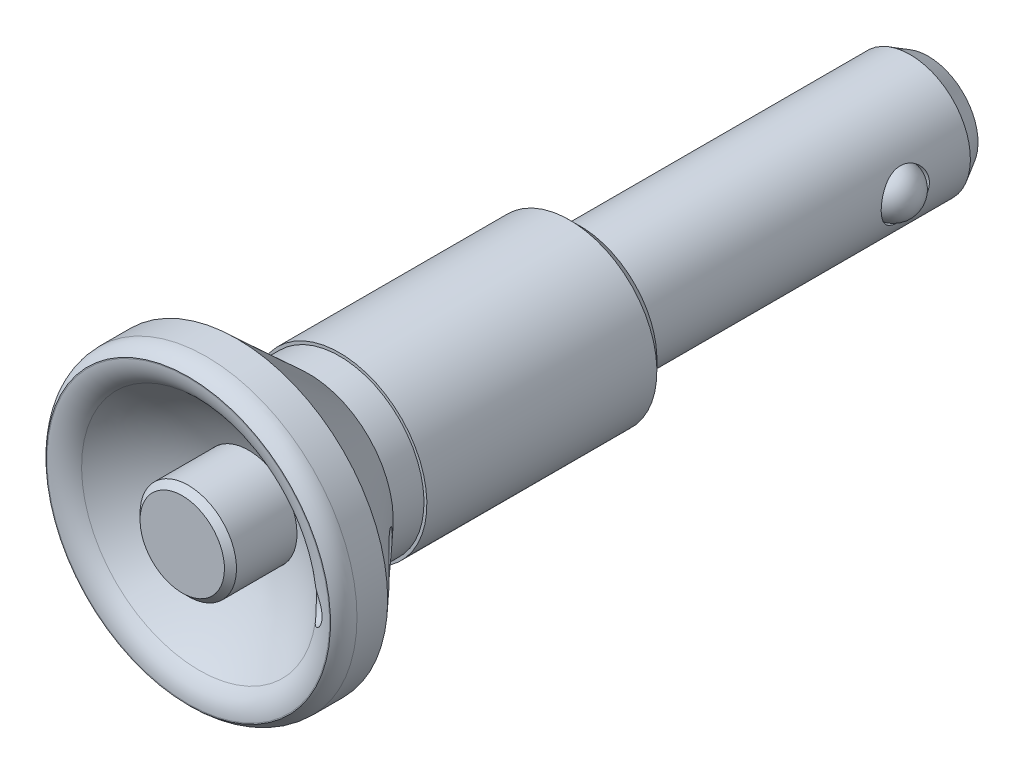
ISO-10303-21;
HEADER;
FILE_DESCRIPTION(('STEP AP214'),'2;1');
FILE_NAME('part.step','',(''),(''),'','','');
FILE_SCHEMA(('AUTOMOTIVE_DESIGN { 1 0 10303 214 1 1 1 1 }'));
ENDSEC;
DATA;
#1=APPLICATION_CONTEXT('core data for automotive mechanical design processes');
#2=APPLICATION_PROTOCOL_DEFINITION('international standard','automotive_design',2000,#1);
#3=PRODUCT_CONTEXT('',#1,'mechanical');
#4=PRODUCT('Part','Part','',(#3));
#5=PRODUCT_RELATED_PRODUCT_CATEGORY('part','',(#4));
#6=PRODUCT_DEFINITION_FORMATION('','',#4);
#7=PRODUCT_DEFINITION_CONTEXT('part definition',#1,'design');
#8=PRODUCT_DEFINITION('design','',#6,#7);
#9=PRODUCT_DEFINITION_SHAPE('','',#8);
#10=(LENGTH_UNIT() NAMED_UNIT(*) SI_UNIT(.MILLI.,.METRE.));
#11=(NAMED_UNIT(*) PLANE_ANGLE_UNIT() SI_UNIT($,.RADIAN.));
#12=(NAMED_UNIT(*) SI_UNIT($,.STERADIAN.) SOLID_ANGLE_UNIT());
#13=UNCERTAINTY_MEASURE_WITH_UNIT(LENGTH_MEASURE(1.E-05),#10,'distance_accuracy_value','');
#14=(GEOMETRIC_REPRESENTATION_CONTEXT(3) GLOBAL_UNCERTAINTY_ASSIGNED_CONTEXT((#13)) GLOBAL_UNIT_ASSIGNED_CONTEXT((#10,
#11,#12)) REPRESENTATION_CONTEXT('',''));
#15=CARTESIAN_POINT('',(0.,0.,0.));
#16=DIRECTION('',(0.,0.,1.));
#17=DIRECTION('',(1.,0.,0.));
#18=AXIS2_PLACEMENT_3D('',#15,#16,#17);
#19=CARTESIAN_POINT('',(0.,0.,-28.9));
#20=DIRECTION('',(0.,0.,-1.));
#21=DIRECTION('',(0.,1.,0.));
#22=AXIS2_PLACEMENT_3D('',#19,#20,#21);
#23=CYLINDRICAL_SURFACE('',#22,2.);
#24=CARTESIAN_POINT('',(0.,0.,-24.9));
#25=DIRECTION('',(0.,0.,-1.));
#26=DIRECTION('',(0.,1.,0.));
#27=AXIS2_PLACEMENT_3D('',#24,#25,#26);
#28=CIRCLE('',#27,2.);
#29=CARTESIAN_POINT('',(0.,2.,-24.9));
#30=VERTEX_POINT('',#29);
#31=EDGE_CURVE('E9',#30,#30,#28,.T.);
#32=ORIENTED_EDGE('',*,*,#31,.F.);
#33=EDGE_LOOP('',(#32));
#34=FACE_BOUND('',#33,.T.);
#35=CARTESIAN_POINT('',(0.,0.,-28.9));
#36=DIRECTION('',(0.,0.,-1.));
#37=DIRECTION('',(0.,1.,0.));
#38=AXIS2_PLACEMENT_3D('',#35,#36,#37);
#39=CIRCLE('',#38,2.);
#40=CARTESIAN_POINT('',(0.,2.,-28.9));
#41=VERTEX_POINT('',#40);
#42=EDGE_CURVE('E433',#41,#41,#39,.T.);
#43=ORIENTED_EDGE('',*,*,#42,.T.);
#44=EDGE_LOOP('',(#43));
#45=FACE_BOUND('',#44,.T.);
#46=ADVANCED_FACE('F14',(#34,#45),#23,.F.);
#47=CARTESIAN_POINT('',(0.,0.,-28.9));
#48=DIRECTION('',(0.,0.,-1.));
#49=DIRECTION('',(0.,1.,0.));
#50=AXIS2_PLACEMENT_3D('',#47,#48,#49);
#51=CYLINDRICAL_SURFACE('',#50,5.);
#52=CARTESIAN_POINT('',(0.,0.,0.));
#53=DIRECTION('',(0.,0.,-1.));
#54=DIRECTION('',(0.,1.,0.));
#55=AXIS2_PLACEMENT_3D('',#52,#53,#54);
#56=CIRCLE('',#55,5.);
#57=CARTESIAN_POINT('',(0.,5.,0.));
#58=VERTEX_POINT('',#57);
#59=EDGE_CURVE('E73',#58,#58,#56,.F.);
#60=ORIENTED_EDGE('',*,*,#59,.F.);
#61=EDGE_LOOP('',(#60));
#62=FACE_BOUND('',#61,.T.);
#63=CARTESIAN_POINT('',(4.58257569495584,2.,-22.));
#64=CARTESIAN_POINT('',(4.58258022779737,1.99999540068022,-22.107123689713));
#65=CARTESIAN_POINT('',(4.58638433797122,1.99134173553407,-22.2144262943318));
#66=CARTESIAN_POINT('',(4.601110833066,1.95706710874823,-22.4259390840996));
#67=CARTESIAN_POINT('',(4.61205140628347,1.93140279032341,-22.5301406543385));
#68=CARTESIAN_POINT('',(4.63960410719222,1.86423554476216,-22.7320518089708));
#69=CARTESIAN_POINT('',(4.65619484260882,1.82279228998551,-22.8297842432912));
#70=CARTESIAN_POINT('',(4.69314677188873,1.72542013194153,-23.0168853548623));
#71=CARTESIAN_POINT('',(4.71350714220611,1.66949439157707,-23.1062558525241));
#72=CARTESIAN_POINT('',(4.75700861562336,1.54132201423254,-23.2792603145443));
#73=CARTESIAN_POINT('',(4.78023917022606,1.46837936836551,-23.3623563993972));
#74=CARTESIAN_POINT('',(4.82612457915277,1.30970909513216,-23.5155290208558));
#75=CARTESIAN_POINT('',(4.84877922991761,1.22397701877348,-23.5856010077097));
#76=CARTESIAN_POINT('',(4.89203407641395,1.03800631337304,-23.7134063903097));
#77=CARTESIAN_POINT('',(4.9125180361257,0.937328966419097,-23.7705442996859));
#78=CARTESIAN_POINT('',(4.94803927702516,0.726825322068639,-23.8668435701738));
#79=CARTESIAN_POINT('',(4.96307877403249,0.617002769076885,-23.9060122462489));
#80=CARTESIAN_POINT('',(4.98538324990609,0.396966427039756,-23.9633414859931));
#81=CARTESIAN_POINT('',(4.99298936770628,0.28702898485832,-23.9824273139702));
#82=CARTESIAN_POINT('',(5.0008031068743,0.0652663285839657,-24.0020284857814));
#83=CARTESIAN_POINT('',(5.00101348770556,-0.0465581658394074,-24.0025507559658));
#84=CARTESIAN_POINT('',(4.99421962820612,-0.262232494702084,-23.9855172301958));
#85=CARTESIAN_POINT('',(4.98761996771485,-0.366177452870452,-23.9689752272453));
#86=CARTESIAN_POINT('',(4.96849291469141,-0.569673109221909,-23.920007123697));
#87=CARTESIAN_POINT('',(4.95596508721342,-0.669223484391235,-23.8875798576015));
#88=CARTESIAN_POINT('',(4.92596824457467,-0.862897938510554,-23.8073635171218));
#89=CARTESIAN_POINT('',(4.90842760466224,-0.956917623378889,-23.7593502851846));
#90=CARTESIAN_POINT('',(4.87014585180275,-1.13580815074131,-23.6495349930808));
#91=CARTESIAN_POINT('',(4.84940364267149,-1.22067584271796,-23.5877282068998));
#92=CARTESIAN_POINT('',(4.80521637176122,-1.38476882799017,-23.4473508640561));
#93=CARTESIAN_POINT('',(4.78168326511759,-1.46325784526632,-23.3679461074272));
#94=CARTESIAN_POINT('',(4.73561660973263,-1.60610741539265,-23.197009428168));
#95=CARTESIAN_POINT('',(4.71308339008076,-1.67046334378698,-23.1054735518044));
#96=CARTESIAN_POINT('',(4.67096897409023,-1.78490418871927,-22.9095809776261));
#97=CARTESIAN_POINT('',(4.65148914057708,-1.83453465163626,-22.8049351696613));
#98=CARTESIAN_POINT('',(4.61887590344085,-1.91517625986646,-22.5877845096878));
#99=CARTESIAN_POINT('',(4.60573837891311,-1.94619949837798,-22.4752848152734));
#100=CARTESIAN_POINT('',(4.58829759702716,-1.9869549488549,-22.2529642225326));
#101=CARTESIAN_POINT('',(4.58350366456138,-1.99787209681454,-22.1433995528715));
#102=CARTESIAN_POINT('',(4.58189497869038,-2.00156132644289,-21.9239227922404));
#103=CARTESIAN_POINT('',(4.58507780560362,-1.99433891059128,-21.8140108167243));
#104=CARTESIAN_POINT('',(4.59856044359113,-1.96303289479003,-21.6035410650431));
#105=CARTESIAN_POINT('',(4.60844457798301,-1.93993306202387,-21.5028070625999));
#106=CARTESIAN_POINT('',(4.6337005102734,-1.87880418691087,-21.3067115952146));
#107=CARTESIAN_POINT('',(4.64907352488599,-1.84077183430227,-21.2113513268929));
#108=CARTESIAN_POINT('',(4.68433781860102,-1.74913563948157,-21.0243976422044));
#109=CARTESIAN_POINT('',(4.70438704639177,-1.69496286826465,-20.9331138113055));
#110=CARTESIAN_POINT('',(4.74650385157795,-1.57316522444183,-20.7605170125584));
#111=CARTESIAN_POINT('',(4.76857224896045,-1.5055348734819,-20.6792081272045));
#112=CARTESIAN_POINT('',(4.81420915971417,-1.35284421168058,-20.5226265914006));
#113=CARTESIAN_POINT('',(4.83776807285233,-1.26686542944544,-20.4482434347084));
#114=CARTESIAN_POINT('',(4.88219794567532,-1.08308363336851,-20.3148229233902));
#115=CARTESIAN_POINT('',(4.90306879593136,-0.985280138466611,-20.2557861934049));
#116=CARTESIAN_POINT('',(4.9398371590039,-0.780279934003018,-20.1549523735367));
#117=CARTESIAN_POINT('',(4.9557358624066,-0.673085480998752,-20.1131511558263));
#118=CARTESIAN_POINT('',(4.98072713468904,-0.452393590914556,-20.0484511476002));
#119=CARTESIAN_POINT('',(4.98982339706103,-0.338899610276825,-20.0255420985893));
#120=CARTESIAN_POINT('',(4.99979008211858,-0.11681651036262,-20.0004952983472));
#121=CARTESIAN_POINT('',(5.00115846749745,-0.00839049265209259,-19.997099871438));
#122=CARTESIAN_POINT('',(4.99686042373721,0.20743383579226,-20.0078554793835));
#123=CARTESIAN_POINT('',(4.99119505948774,0.314832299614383,-20.0220038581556));
#124=CARTESIAN_POINT('',(4.97371513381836,0.522170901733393,-20.0665467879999));
#125=CARTESIAN_POINT('',(4.96209480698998,0.622238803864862,-20.0964289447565));
#126=CARTESIAN_POINT('',(4.93394947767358,0.815922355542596,-20.1710528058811));
#127=CARTESIAN_POINT('',(4.91742357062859,0.909536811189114,-20.2157972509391));
#128=CARTESIAN_POINT('',(4.88018094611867,1.09220303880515,-20.3211031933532));
#129=CARTESIAN_POINT('',(4.859311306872,1.18087037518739,-20.3822762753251));
#130=CARTESIAN_POINT('',(4.8158940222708,1.34705404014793,-20.517788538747));
#131=CARTESIAN_POINT('',(4.79334568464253,1.42456572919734,-20.5921331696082));
#132=CARTESIAN_POINT('',(4.74737767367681,1.57120121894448,-20.7573151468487));
#133=CARTESIAN_POINT('',(4.72399047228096,1.63950871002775,-20.8488885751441));
#134=CARTESIAN_POINT('',(4.68049656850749,1.75984762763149,-21.0429424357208));
#135=CARTESIAN_POINT('',(4.66039025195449,1.81187714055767,-21.1454241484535));
#136=CARTESIAN_POINT('',(4.62758914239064,1.89399048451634,-21.3490361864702));
#137=CARTESIAN_POINT('',(4.61439096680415,1.92562535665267,-21.4494616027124));
#138=CARTESIAN_POINT('',(4.5944582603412,1.97271990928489,-21.6544890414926));
#139=CARTESIAN_POINT('',(4.58770572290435,1.98822466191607,-21.7590785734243));
#140=CARTESIAN_POINT('',(4.5839176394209,1.99692202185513,-21.8867782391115));
#141=CARTESIAN_POINT('',(4.58341531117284,1.99807530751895,-21.9094014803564));
#142=CARTESIAN_POINT('',(4.58274384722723,1.9996148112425,-21.9546804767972));
#143=CARTESIAN_POINT('',(4.5825747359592,2.0000009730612,-21.9773362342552));
#144=CARTESIAN_POINT('',(4.58257569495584,2.,-22.));
#145=B_SPLINE_CURVE_WITH_KNOTS('',3,(#63,#64,#65,#66,#67,#68,#69,#70,#71,#72,#73,#74,#75,#76,
#77,#78,#79,#80,#81,#82,#83,#84,#85,#86,#87,#88,#89,#90,#91,#92,#93,#94,#95,#96,#97,#98,#99,
#100,#101,#102,#103,#104,#105,#106,#107,#108,#109,#110,#111,#112,#113,#114,#115,#116,#117,#118,
#119,#120,#121,#122,#123,#124,#125,#126,#127,#128,#129,#130,#131,#132,#133,#134,#135,#136,#137,
#138,#139,#140,#141,#142,#143,#144),.UNSPECIFIED.,.T.,.F.,(4,2,2,2,2,2,2,2,2,2,2,2,2,2,2,2,2,2,
2,2,2,2,2,2,2,2,2,2,2,2,2,2,2,2,2,2,2,2,2,2,4),(0.,0.321277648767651,0.643377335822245,
0.964270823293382,1.2850942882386,1.62255618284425,1.96013574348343,2.31102669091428,
2.6617746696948,2.99554182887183,3.32918445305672,3.64408644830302,3.95901155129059,
4.27868300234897,4.5984641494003,4.93924044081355,5.28012807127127,5.63064458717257,
5.980933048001,6.30982147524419,6.63861014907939,6.94867248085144,7.25880358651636,
7.581511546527,7.9043511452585,8.25103734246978,8.59773764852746,8.94435487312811,
9.29078375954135,9.61461039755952,9.938388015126,10.2522199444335,10.5661097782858,
10.8938705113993,11.2217671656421,11.5699625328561,11.9181988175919,12.2351666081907,
12.5512463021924,12.619212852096,12.6871843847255),.UNSPECIFIED.);
#146=CARTESIAN_POINT('',(4.58257569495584,2.,-22.));
#147=VERTEX_POINT('',#146);
#148=EDGE_CURVE('E417',#147,#147,#145,.T.);
#149=ORIENTED_EDGE('',*,*,#148,.T.);
#150=EDGE_LOOP('',(#149));
#151=FACE_BOUND('',#150,.T.);
#152=CARTESIAN_POINT('',(0.,0.,-27.4));
#153=DIRECTION('',(0.,0.,-1.));
#154=DIRECTION('',(0.,1.,0.));
#155=AXIS2_PLACEMENT_3D('',#152,#153,#154);
#156=CIRCLE('',#155,5.);
#157=CARTESIAN_POINT('',(0.,5.,-27.4));
#158=VERTEX_POINT('',#157);
#159=EDGE_CURVE('E67',#158,#158,#156,.T.);
#160=ORIENTED_EDGE('',*,*,#159,.F.);
#161=EDGE_LOOP('',(#160));
#162=FACE_BOUND('',#161,.T.);
#163=CARTESIAN_POINT('',(-4.58257569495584,2.,-22.));
#164=CARTESIAN_POINT('',(-4.58258022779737,1.99999540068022,-21.892876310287));
#165=CARTESIAN_POINT('',(-4.58638433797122,1.99134173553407,-21.7855737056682));
#166=CARTESIAN_POINT('',(-4.601110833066,1.95706710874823,-21.5740609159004));
#167=CARTESIAN_POINT('',(-4.61205140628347,1.93140279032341,-21.4698593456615));
#168=CARTESIAN_POINT('',(-4.63960410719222,1.86423554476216,-21.2679481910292));
#169=CARTESIAN_POINT('',(-4.65619484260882,1.82279228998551,-21.1702157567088));
#170=CARTESIAN_POINT('',(-4.69314677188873,1.72542013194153,-20.9831146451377));
#171=CARTESIAN_POINT('',(-4.71350714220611,1.66949439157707,-20.8937441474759));
#172=CARTESIAN_POINT('',(-4.75700861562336,1.54132201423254,-20.7207396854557));
#173=CARTESIAN_POINT('',(-4.78023917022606,1.46837936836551,-20.6376436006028));
#174=CARTESIAN_POINT('',(-4.82612457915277,1.30970909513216,-20.4844709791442));
#175=CARTESIAN_POINT('',(-4.84877922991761,1.22397701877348,-20.4143989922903));
#176=CARTESIAN_POINT('',(-4.89203407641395,1.03800631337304,-20.2865936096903));
#177=CARTESIAN_POINT('',(-4.9125180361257,0.937328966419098,-20.2294557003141));
#178=CARTESIAN_POINT('',(-4.94803927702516,0.72682532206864,-20.1331564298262));
#179=CARTESIAN_POINT('',(-4.96307877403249,0.617002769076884,-20.0939877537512));
#180=CARTESIAN_POINT('',(-4.98538324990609,0.396966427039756,-20.0366585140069));
#181=CARTESIAN_POINT('',(-4.99298936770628,0.28702898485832,-20.0175726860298));
#182=CARTESIAN_POINT('',(-5.0008031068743,0.0652663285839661,-19.9979715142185));
#183=CARTESIAN_POINT('',(-5.00101348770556,-0.0465581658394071,-19.9974492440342));
#184=CARTESIAN_POINT('',(-4.99421962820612,-0.262232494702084,-20.0144827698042));
#185=CARTESIAN_POINT('',(-4.98761996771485,-0.366177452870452,-20.0310247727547));
#186=CARTESIAN_POINT('',(-4.96849291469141,-0.569673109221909,-20.079992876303));
#187=CARTESIAN_POINT('',(-4.95596508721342,-0.669223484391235,-20.1124201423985));
#188=CARTESIAN_POINT('',(-4.92596824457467,-0.862897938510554,-20.1926364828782));
#189=CARTESIAN_POINT('',(-4.90842760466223,-0.956917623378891,-20.2406497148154));
#190=CARTESIAN_POINT('',(-4.87014585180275,-1.13580815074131,-20.3504650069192));
#191=CARTESIAN_POINT('',(-4.84940364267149,-1.22067584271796,-20.4122717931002));
#192=CARTESIAN_POINT('',(-4.80521637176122,-1.38476882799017,-20.5526491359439));
#193=CARTESIAN_POINT('',(-4.78168326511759,-1.46325784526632,-20.6320538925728));
#194=CARTESIAN_POINT('',(-4.73561660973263,-1.60610741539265,-20.802990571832));
#195=CARTESIAN_POINT('',(-4.71308339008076,-1.67046334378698,-20.8945264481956));
#196=CARTESIAN_POINT('',(-4.67096897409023,-1.78490418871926,-21.0904190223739));
#197=CARTESIAN_POINT('',(-4.65148914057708,-1.83453465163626,-21.1950648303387));
#198=CARTESIAN_POINT('',(-4.61887590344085,-1.91517625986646,-21.4122154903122));
#199=CARTESIAN_POINT('',(-4.60573837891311,-1.94619949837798,-21.5247151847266));
#200=CARTESIAN_POINT('',(-4.58829759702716,-1.9869549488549,-21.7470357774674));
#201=CARTESIAN_POINT('',(-4.58350366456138,-1.99787209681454,-21.8566004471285));
#202=CARTESIAN_POINT('',(-4.58189497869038,-2.00156132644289,-22.0760772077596));
#203=CARTESIAN_POINT('',(-4.58507780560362,-1.99433891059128,-22.1859891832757));
#204=CARTESIAN_POINT('',(-4.59856044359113,-1.96303289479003,-22.3964589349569));
#205=CARTESIAN_POINT('',(-4.60844457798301,-1.93993306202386,-22.4971929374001));
#206=CARTESIAN_POINT('',(-4.6337005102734,-1.87880418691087,-22.6932884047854));
#207=CARTESIAN_POINT('',(-4.64907352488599,-1.84077183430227,-22.7886486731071));
#208=CARTESIAN_POINT('',(-4.68433781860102,-1.74913563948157,-22.9756023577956));
#209=CARTESIAN_POINT('',(-4.70438704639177,-1.69496286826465,-23.0668861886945));
#210=CARTESIAN_POINT('',(-4.74650385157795,-1.57316522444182,-23.2394829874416));
#211=CARTESIAN_POINT('',(-4.76857224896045,-1.5055348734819,-23.3207918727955));
#212=CARTESIAN_POINT('',(-4.81420915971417,-1.35284421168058,-23.4773734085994));
#213=CARTESIAN_POINT('',(-4.83776807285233,-1.26686542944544,-23.5517565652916));
#214=CARTESIAN_POINT('',(-4.88219794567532,-1.08308363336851,-23.6851770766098));
#215=CARTESIAN_POINT('',(-4.90306879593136,-0.98528013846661,-23.7442138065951));
#216=CARTESIAN_POINT('',(-4.9398371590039,-0.780279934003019,-23.8450476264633));
#217=CARTESIAN_POINT('',(-4.9557358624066,-0.673085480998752,-23.8868488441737));
#218=CARTESIAN_POINT('',(-4.98072713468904,-0.452393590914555,-23.9515488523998));
#219=CARTESIAN_POINT('',(-4.98982339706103,-0.338899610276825,-23.9744579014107));
#220=CARTESIAN_POINT('',(-4.99979008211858,-0.11681651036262,-23.9995047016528));
#221=CARTESIAN_POINT('',(-5.00115846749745,-0.00839049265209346,-24.002900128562));
#222=CARTESIAN_POINT('',(-4.99686042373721,0.207433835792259,-23.9921445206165));
#223=CARTESIAN_POINT('',(-4.99119505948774,0.314832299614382,-23.9779961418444));
#224=CARTESIAN_POINT('',(-4.97371513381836,0.522170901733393,-23.9334532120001));
#225=CARTESIAN_POINT('',(-4.96209480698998,0.622238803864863,-23.9035710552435));
#226=CARTESIAN_POINT('',(-4.93394947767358,0.815922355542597,-23.8289471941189));
#227=CARTESIAN_POINT('',(-4.91742357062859,0.909536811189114,-23.7842027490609));
#228=CARTESIAN_POINT('',(-4.88018094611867,1.09220303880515,-23.6788968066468));
#229=CARTESIAN_POINT('',(-4.859311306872,1.18087037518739,-23.6177237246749));
#230=CARTESIAN_POINT('',(-4.8158940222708,1.34705404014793,-23.482211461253));
#231=CARTESIAN_POINT('',(-4.79334568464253,1.42456572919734,-23.4078668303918));
#232=CARTESIAN_POINT('',(-4.74737767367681,1.57120121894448,-23.2426848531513));
#233=CARTESIAN_POINT('',(-4.72399047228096,1.63950871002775,-23.1511114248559));
#234=CARTESIAN_POINT('',(-4.68049656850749,1.75984762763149,-22.9570575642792));
#235=CARTESIAN_POINT('',(-4.66039025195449,1.81187714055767,-22.8545758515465));
#236=CARTESIAN_POINT('',(-4.62758914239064,1.89399048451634,-22.6509638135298));
#237=CARTESIAN_POINT('',(-4.61439096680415,1.92562535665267,-22.5505383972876));
#238=CARTESIAN_POINT('',(-4.5944582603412,1.97271990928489,-22.3455109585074));
#239=CARTESIAN_POINT('',(-4.58770572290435,1.98822466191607,-22.2409214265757));
#240=CARTESIAN_POINT('',(-4.5839176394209,1.99692202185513,-22.1132217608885));
#241=CARTESIAN_POINT('',(-4.58341531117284,1.99807530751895,-22.0905985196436));
#242=CARTESIAN_POINT('',(-4.58274384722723,1.9996148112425,-22.0453195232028));
#243=CARTESIAN_POINT('',(-4.5825747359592,2.0000009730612,-22.0226637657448));
#244=CARTESIAN_POINT('',(-4.58257569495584,2.,-22.));
#245=B_SPLINE_CURVE_WITH_KNOTS('',3,(#163,#164,#165,#166,#167,#168,#169,#170,#171,#172,#173,
#174,#175,#176,#177,#178,#179,#180,#181,#182,#183,#184,#185,#186,#187,#188,#189,#190,#191,#192,
#193,#194,#195,#196,#197,#198,#199,#200,#201,#202,#203,#204,#205,#206,#207,#208,#209,#210,#211,
#212,#213,#214,#215,#216,#217,#218,#219,#220,#221,#222,#223,#224,#225,#226,#227,#228,#229,#230,
#231,#232,#233,#234,#235,#236,#237,#238,#239,#240,#241,#242,#243,#244),.UNSPECIFIED.,.T.,.F.,(4,
2,2,2,2,2,2,2,2,2,2,2,2,2,2,2,2,2,2,2,2,2,2,2,2,2,2,2,2,2,2,2,2,2,2,2,2,2,2,2,4),(0.,
0.321277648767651,0.643377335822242,0.964270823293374,1.28509428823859,1.62255618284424,
1.96013574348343,2.31102669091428,2.6617746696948,2.99554182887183,3.32918445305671,
3.64408644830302,3.95901155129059,4.27868300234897,4.5984641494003,4.93924044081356,
5.28012807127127,5.63064458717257,5.98093304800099,6.30982147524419,6.63861014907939,
6.94867248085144,7.25880358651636,7.581511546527,7.9043511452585,8.25103734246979,
8.59773764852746,8.94435487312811,9.29078375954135,9.61461039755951,9.938388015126,
10.2522199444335,10.5661097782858,10.8938705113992,11.2217671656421,11.5699625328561,
11.9181988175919,12.2351666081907,12.5512463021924,12.619212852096,12.6871843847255),.UNSPECIFIED.);
#246=CARTESIAN_POINT('',(-4.58257569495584,2.,-22.));
#247=VERTEX_POINT('',#246);
#248=EDGE_CURVE('E61',#247,#247,#245,.T.);
#249=ORIENTED_EDGE('',*,*,#248,.T.);
#250=EDGE_LOOP('',(#249));
#251=FACE_BOUND('',#250,.T.);
#252=ADVANCED_FACE('F386',(#62,#151,#162,#251),#51,.T.);
#253=CARTESIAN_POINT('',(2.,0.,-28.9));
#254=DIRECTION('',(0.,0.,-1.));
#255=DIRECTION('',(0.,1.,0.));
#256=AXIS2_PLACEMENT_3D('',#253,#254,#255);
#257=PLANE('',#256);
#258=CARTESIAN_POINT('',(0.,0.,-28.9));
#259=DIRECTION('',(0.,0.,-1.));
#260=DIRECTION('',(0.,1.,0.));
#261=AXIS2_PLACEMENT_3D('',#258,#259,#260);
#262=CIRCLE('',#261,4.13397459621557);
#263=CARTESIAN_POINT('',(0.,4.13397459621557,-28.9));
#264=VERTEX_POINT('',#263);
#265=EDGE_CURVE('E437',#264,#264,#262,.T.);
#266=ORIENTED_EDGE('',*,*,#265,.T.);
#267=EDGE_LOOP('',(#266));
#268=FACE_BOUND('',#267,.T.);
#269=ORIENTED_EDGE('',*,*,#42,.F.);
#270=EDGE_LOOP('',(#269));
#271=FACE_BOUND('',#270,.T.);
#272=ADVANCED_FACE('F376',(#268,#271),#257,.T.);
#273=CARTESIAN_POINT('',(0.,0.,-28.9));
#274=DIRECTION('',(0.,0.,1.));
#275=DIRECTION('',(0.,-1.,0.));
#276=AXIS2_PLACEMENT_3D('',#273,#274,#275);
#277=CONICAL_SURFACE('',#276,4.13397459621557,0.523598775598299);
#278=ORIENTED_EDGE('',*,*,#159,.T.);
#279=EDGE_LOOP('',(#278));
#280=FACE_BOUND('',#279,.T.);
#281=ORIENTED_EDGE('',*,*,#265,.F.);
#282=EDGE_LOOP('',(#281));
#283=FACE_BOUND('',#282,.T.);
#284=ADVANCED_FACE('F368',(#280,#283),#277,.T.);
#285=CARTESIAN_POINT('',(6.,0.,-22.));
#286=DIRECTION('',(1.,0.,0.));
#287=DIRECTION('',(0.,1.,0.));
#288=AXIS2_PLACEMENT_3D('',#285,#286,#287);
#289=CYLINDRICAL_SURFACE('',#288,2.);
#290=CARTESIAN_POINT('',(3.69295257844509,2.,-22.));
#291=CARTESIAN_POINT('',(3.69296124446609,1.99999252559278,-21.8950365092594));
#292=CARTESIAN_POINT('',(3.69749476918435,1.99168229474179,-21.7899198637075));
#293=CARTESIAN_POINT('',(3.71499510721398,1.95883523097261,-21.5828549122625));
#294=CARTESIAN_POINT('',(3.72798128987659,1.93426112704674,-21.4809144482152));
#295=CARTESIAN_POINT('',(3.76054820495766,1.87014699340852,-21.2835779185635));
#296=CARTESIAN_POINT('',(3.78009636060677,1.83068077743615,-21.1881522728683));
#297=CARTESIAN_POINT('',(3.82353505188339,1.73812635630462,-21.0052997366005));
#298=CARTESIAN_POINT('',(3.84742546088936,1.68503854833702,-20.9178726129));
#299=CARTESIAN_POINT('',(3.89903612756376,1.56210627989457,-20.7462961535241));
#300=CARTESIAN_POINT('',(3.92690909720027,1.49130855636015,-20.6628754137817));
#301=CARTESIAN_POINT('',(3.98210623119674,1.33695443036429,-20.5085333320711));
#302=CARTESIAN_POINT('',(4.00943013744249,1.25339217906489,-20.437617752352));
#303=CARTESIAN_POINT('',(4.0624063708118,1.06976932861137,-20.3061632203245));
#304=CARTESIAN_POINT('',(4.08786122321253,0.969021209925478,-20.2464976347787));
#305=CARTESIAN_POINT('',(4.1322840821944,0.757479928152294,-20.1452903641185));
#306=CARTESIAN_POINT('',(4.15125580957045,0.646692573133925,-20.1037382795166));
#307=CARTESIAN_POINT('',(4.17948005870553,0.425917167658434,-20.0427479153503));
#308=CARTESIAN_POINT('',(4.18928822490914,0.316352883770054,-20.0220384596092));
#309=CARTESIAN_POINT('',(4.20013773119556,0.0948978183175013,-19.9991585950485));
#310=CARTESIAN_POINT('',(4.20118382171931,-0.0169916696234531,-19.996978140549));
#311=CARTESIAN_POINT('',(4.1946744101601,-0.230460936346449,-20.0106738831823));
#312=CARTESIAN_POINT('',(4.18779244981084,-0.332156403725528,-20.0251360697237));
#313=CARTESIAN_POINT('',(4.1671904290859,-0.531473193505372,-20.0692085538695));
#314=CARTESIAN_POINT('',(4.15346986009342,-0.629094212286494,-20.0988199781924));
#315=CARTESIAN_POINT('',(4.12021451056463,-0.819264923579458,-20.1726068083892));
#316=CARTESIAN_POINT('',(4.10059733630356,-0.911719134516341,-20.2169896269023));
#317=CARTESIAN_POINT('',(4.05736238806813,-1.08810289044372,-20.3188060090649));
#318=CARTESIAN_POINT('',(4.03374315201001,-1.17202930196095,-20.376244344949));
#319=CARTESIAN_POINT('',(3.98232079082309,-1.33682830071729,-20.508356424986));
#320=CARTESIAN_POINT('',(3.95433239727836,-1.41678585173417,-20.5841006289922));
#321=CARTESIAN_POINT('',(3.89872441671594,-1.56333053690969,-20.7477715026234));
#322=CARTESIAN_POINT('',(3.87110507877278,-1.62990902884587,-20.8357059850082));
#323=CARTESIAN_POINT('',(3.81780436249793,-1.75125633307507,-21.0270633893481));
#324=CARTESIAN_POINT('',(3.79230552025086,-1.80520353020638,-21.1310630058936));
#325=CARTESIAN_POINT('',(3.74853610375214,-1.89443193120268,-21.3481814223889));
#326=CARTESIAN_POINT('',(3.73025862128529,-1.92973098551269,-21.4612913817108));
#327=CARTESIAN_POINT('',(3.70489726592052,-1.97796079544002,-21.6842923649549));
#328=CARTESIAN_POINT('',(3.69706613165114,-1.99239193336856,-21.7937711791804));
#329=CARTESIAN_POINT('',(3.69134421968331,-2.00297881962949,-22.013842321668));
#330=CARTESIAN_POINT('',(3.69344777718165,-1.99914498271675,-22.1244339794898));
#331=CARTESIAN_POINT('',(3.70656984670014,-1.97468704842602,-22.3324720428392));
#332=CARTESIAN_POINT('',(3.71672580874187,-1.95568631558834,-22.4301719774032));
#333=CARTESIAN_POINT('',(3.74358473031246,-1.90376463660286,-22.6208457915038));
#334=CARTESIAN_POINT('',(3.76028958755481,-1.8708396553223,-22.7138182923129));
#335=CARTESIAN_POINT('',(3.79928393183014,-1.79036865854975,-22.8972604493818));
#336=CARTESIAN_POINT('',(3.82179608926,-1.74221652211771,-22.9874151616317));
#337=CARTESIAN_POINT('',(3.86963561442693,-1.63320542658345,-23.1588668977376));
#338=CARTESIAN_POINT('',(3.89496439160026,-1.5723400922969,-23.2401594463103));
#339=CARTESIAN_POINT('',(3.94900124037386,-1.43163394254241,-23.401103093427));
#340=CARTESIAN_POINT('',(3.97776977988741,-1.35043069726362,-23.4795481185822));
#341=CARTESIAN_POINT('',(4.03293385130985,-1.17547949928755,-23.6220285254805));
#342=CARTESIAN_POINT('',(4.05932880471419,-1.08172850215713,-23.6860604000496));
#343=CARTESIAN_POINT('',(4.10741012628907,-0.881934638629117,-23.7987682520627));
#344=CARTESIAN_POINT('',(4.12900486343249,-0.775703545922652,-23.8471523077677));
#345=CARTESIAN_POINT('',(4.16436909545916,-0.55528985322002,-23.9249103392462));
#346=CARTESIAN_POINT('',(4.17814481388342,-0.441113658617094,-23.9542994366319));
#347=CARTESIAN_POINT('',(4.19540926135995,-0.218647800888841,-23.9909275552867));
#348=CARTESIAN_POINT('',(4.19968035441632,-0.110695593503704,-23.9998531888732));
#349=CARTESIAN_POINT('',(4.1998175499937,0.105223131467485,-24.0001430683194));
#350=CARTESIAN_POINT('',(4.19568607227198,0.213189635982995,-23.9915123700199));
#351=CARTESIAN_POINT('',(4.17993566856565,0.419731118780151,-23.9581010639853));
#352=CARTESIAN_POINT('',(4.168749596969,0.518493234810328,-23.9342532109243));
#353=CARTESIAN_POINT('',(4.1403533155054,0.710491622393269,-23.872267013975));
#354=CARTESIAN_POINT('',(4.12314216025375,0.803727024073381,-23.8341264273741));
#355=CARTESIAN_POINT('',(4.08331986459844,0.986690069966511,-23.7428034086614));
#356=CARTESIAN_POINT('',(4.06050114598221,1.07607281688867,-23.6890230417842));
#357=CARTESIAN_POINT('',(4.01195381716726,1.24493254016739,-23.5687268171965));
#358=CARTESIAN_POINT('',(3.98622388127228,1.32440496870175,-23.5022051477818));
#359=CARTESIAN_POINT('',(3.9317186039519,1.47877758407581,-23.3512584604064));
#360=CARTESIAN_POINT('',(3.90287905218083,1.55260530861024,-23.2657556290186));
#361=CARTESIAN_POINT('',(3.8474945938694,1.68518766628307,-23.0830092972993));
#362=CARTESIAN_POINT('',(3.82095142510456,1.74393094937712,-22.9857570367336));
#363=CARTESIAN_POINT('',(3.77299479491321,1.84543916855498,-22.7795828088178));
#364=CARTESIAN_POINT('',(3.75168341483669,1.88789405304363,-22.6704807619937));
#365=CARTESIAN_POINT('',(3.72647961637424,1.93689798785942,-22.5018569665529));
#366=CARTESIAN_POINT('',(3.71920915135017,1.95078018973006,-22.4448752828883));
#367=CARTESIAN_POINT('',(3.70719734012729,1.97351358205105,-22.3296687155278));
#368=CARTESIAN_POINT('',(3.7024541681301,1.98236840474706,-22.2714447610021));
#369=CARTESIAN_POINT('',(3.69705078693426,1.99241849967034,-22.1775698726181));
#370=CARTESIAN_POINT('',(3.69551719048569,1.99525904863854,-22.1421353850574));
#371=CARTESIAN_POINT('',(3.69346659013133,1.99905111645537,-22.0711398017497));
#372=CARTESIAN_POINT('',(3.69294964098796,2.00000253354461,-22.035578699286));
#373=CARTESIAN_POINT('',(3.69295257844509,2.,-22.));
#374=B_SPLINE_CURVE_WITH_KNOTS('',3,(#290,#291,#292,#293,#294,#295,#296,#297,#298,#299,#300,
#301,#302,#303,#304,#305,#306,#307,#308,#309,#310,#311,#312,#313,#314,#315,#316,#317,#318,#319,
#320,#321,#322,#323,#324,#325,#326,#327,#328,#329,#330,#331,#332,#333,#334,#335,#336,#337,#338,
#339,#340,#341,#342,#343,#344,#345,#346,#347,#348,#349,#350,#351,#352,#353,#354,#355,#356,#357,
#358,#359,#360,#361,#362,#363,#364,#365,#366,#367,#368,#369,#370,#371,#372,#373),.UNSPECIFIED.,
.T.,.F.,(4,2,2,2,2,2,2,2,2,2,2,2,2,2,2,2,2,2,2,2,2,2,2,2,2,2,2,2,2,2,2,2,2,2,2,2,2,2,2,2,2,4),
(0.,0.314747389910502,0.630218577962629,0.94414622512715,1.25806471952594,1.59535393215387,
1.93279816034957,2.2904080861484,2.64781242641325,2.98178553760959,3.31557757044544,
3.62297848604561,3.9304022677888,4.24233891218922,4.55438976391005,4.89383754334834,
5.2335038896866,5.59132862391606,5.94881021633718,6.27903319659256,6.60906790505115,
6.90786821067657,7.20675516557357,7.51947407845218,7.83235018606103,8.18030775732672,
8.52834990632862,8.88255362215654,9.2364750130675,9.55997846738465,9.88338877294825,
10.1886636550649,10.4939864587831,10.8130037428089,11.1321668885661,11.4803449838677,
11.8287842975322,12.1835611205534,12.3606240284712,12.5375588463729,12.6442406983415,
12.750928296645),.UNSPECIFIED.);
#375=CARTESIAN_POINT('',(3.85225966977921,1.67272059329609,-23.0963602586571));
#376=VERTEX_POINT('',#375);
#377=CARTESIAN_POINT('',(3.85225966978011,-1.67272059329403,-23.0963602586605));
#378=VERTEX_POINT('',#377);
#379=EDGE_CURVE('E63',#376,#378,#374,.T.);
#380=ORIENTED_EDGE('',*,*,#379,.F.);
#381=CARTESIAN_POINT('',(4.19974984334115,0.,-23.9999999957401));
#382=CARTESIAN_POINT('',(4.19974979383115,0.112133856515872,-23.9999951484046));
#383=CARTESIAN_POINT('',(4.19927754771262,0.224413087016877,-23.9905315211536));
#384=CARTESIAN_POINT('',(4.19737987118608,0.445943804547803,-23.9528961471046));
#385=CARTESIAN_POINT('',(4.19595246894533,0.555188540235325,-23.9246857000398));
#386=CARTESIAN_POINT('',(4.19212216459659,0.767313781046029,-23.8503623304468));
#387=CARTESIAN_POINT('',(4.18972003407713,0.870199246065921,-23.8042635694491));
#388=CARTESIAN_POINT('',(4.18389859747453,1.06670436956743,-23.6955084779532));
#389=CARTESIAN_POINT('',(4.18047981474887,1.16032876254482,-23.6328606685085));
#390=CARTESIAN_POINT('',(4.17254294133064,1.33575977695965,-23.492765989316));
#391=CARTESIAN_POINT('',(4.16802447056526,1.41756229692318,-23.4153140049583));
#392=CARTESIAN_POINT('',(4.15774347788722,1.56703120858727,-23.2478047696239));
#393=CARTESIAN_POINT('',(4.15198042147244,1.63469150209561,-23.1577421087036));
#394=CARTESIAN_POINT('',(4.13889872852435,1.75400147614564,-22.9675249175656));
#395=CARTESIAN_POINT('',(4.13157812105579,1.80563066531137,-22.8673576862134));
#396=CARTESIAN_POINT('',(4.11478827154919,1.89126247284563,-22.6600522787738));
#397=CARTESIAN_POINT('',(4.10532235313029,1.92529209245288,-22.552925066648));
#398=CARTESIAN_POINT('',(4.08797788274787,1.96230917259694,-22.3903489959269));
#399=CARTESIAN_POINT('',(4.08173176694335,1.97228597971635,-22.3362647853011));
#400=CARTESIAN_POINT('',(4.06714094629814,1.98774141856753,-22.2278123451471));
#401=CARTESIAN_POINT('',(4.05879592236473,1.99321936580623,-22.1734440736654));
#402=CARTESIAN_POINT('',(4.04230132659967,1.99805364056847,-22.0921402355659));
#403=CARTESIAN_POINT('',(4.0361535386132,1.99910232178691,-22.0651242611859));
#404=CARTESIAN_POINT('',(4.02444072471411,1.99970372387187,-22.0347632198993));
#405=CARTESIAN_POINT('',(4.02250757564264,1.99977855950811,-22.030121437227));
#406=CARTESIAN_POINT('',(4.01814107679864,1.99989236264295,-22.0211873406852));
#407=CARTESIAN_POINT('',(4.01572346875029,1.99993228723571,-22.0168888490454));
#408=CARTESIAN_POINT('',(4.01208715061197,1.99996240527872,-22.0122892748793));
#409=CARTESIAN_POINT('',(4.01145667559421,1.99996683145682,-22.011541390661));
#410=CARTESIAN_POINT('',(4.01012709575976,1.99997459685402,-22.0101050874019));
#411=CARTESIAN_POINT('',(4.0094278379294,1.99997793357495,-22.0094168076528));
#412=CARTESIAN_POINT('',(4.0079377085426,1.99998361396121,-22.0081222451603));
#413=CARTESIAN_POINT('',(4.0071456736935,1.99998594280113,-22.0075172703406));
#414=CARTESIAN_POINT('',(4.00546606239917,1.99998963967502,-22.0064591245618));
#415=CARTESIAN_POINT('',(4.00457899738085,1.99999101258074,-22.0060051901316));
#416=CARTESIAN_POINT('',(4.00309539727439,1.99999254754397,-22.0054637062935));
#417=CARTESIAN_POINT('',(4.00252608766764,1.99999297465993,-22.005302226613));
#418=CARTESIAN_POINT('',(4.00136845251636,1.99999355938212,-22.0050769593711));
#419=CARTESIAN_POINT('',(4.00078014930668,1.99999371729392,-22.0050130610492));
#420=CARTESIAN_POINT('',(3.99960008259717,1.99999377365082,-22.0049905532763));
#421=CARTESIAN_POINT('',(3.99900831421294,1.99999367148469,-22.0050321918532));
#422=CARTESIAN_POINT('',(3.99784054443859,1.99999320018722,-22.0052160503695));
#423=CARTESIAN_POINT('',(3.99726456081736,1.99999283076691,-22.0053583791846));
#424=CARTESIAN_POINT('',(3.99596613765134,1.99999164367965,-22.0057864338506));
#425=CARTESIAN_POINT('',(3.99525401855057,1.99999072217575,-22.0061030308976));
#426=CARTESIAN_POINT('',(3.99388863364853,1.99998832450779,-22.0068440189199));
#427=CARTESIAN_POINT('',(3.99323551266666,1.99998684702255,-22.0072686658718));
#428=CARTESIAN_POINT('',(3.99148747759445,1.9999818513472,-22.008559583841));
#429=CARTESIAN_POINT('',(3.99045448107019,1.99997764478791,-22.0095084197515));
#430=CARTESIAN_POINT('',(3.98852680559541,1.99996699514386,-22.011536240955));
#431=CARTESIAN_POINT('',(3.98763259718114,1.99996054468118,-22.0126156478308));
#432=CARTESIAN_POINT('',(3.98395592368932,1.99992720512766,-22.0174572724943));
#433=CARTESIAN_POINT('',(3.9816608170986,1.99988785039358,-22.0215770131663));
#434=CARTESIAN_POINT('',(3.9775382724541,1.99977908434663,-22.0300410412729));
#435=CARTESIAN_POINT('',(3.97571429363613,1.99970946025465,-22.0343867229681));
#436=CARTESIAN_POINT('',(3.96598133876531,1.99922202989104,-22.0594419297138));
#437=CARTESIAN_POINT('',(3.96058685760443,1.99847042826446,-22.0810801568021));
#438=CARTESIAN_POINT('',(3.95094475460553,1.9962386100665,-22.1245892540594));
#439=CARTESIAN_POINT('',(3.94670543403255,1.99475332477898,-22.1464606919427));
#440=CARTESIAN_POINT('',(3.93509414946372,1.98918869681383,-22.2122537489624));
#441=CARTESIAN_POINT('',(3.92883855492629,1.98400126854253,-22.2563147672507));
#442=CARTESIAN_POINT('',(3.91750349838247,1.97070199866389,-22.3439535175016));
#443=CARTESIAN_POINT('',(3.91242053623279,1.96259904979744,-22.3875323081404));
#444=CARTESIAN_POINT('',(3.89827773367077,1.93388686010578,-22.5176547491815));
#445=CARTESIAN_POINT('',(3.89034994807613,1.90888988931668,-22.6033988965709));
#446=CARTESIAN_POINT('',(3.87421219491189,1.83976683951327,-22.7923428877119));
#447=CARTESIAN_POINT('',(3.86644907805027,1.79238269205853,-22.8943953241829));
#448=CARTESIAN_POINT('',(3.8525798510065,1.68112524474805,-23.0892232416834));
#449=CARTESIAN_POINT('',(3.84647416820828,1.61724770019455,-23.1819963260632));
#450=CARTESIAN_POINT('',(3.83555894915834,1.4747938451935,-23.3555771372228));
#451=CARTESIAN_POINT('',(3.83074952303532,1.39621628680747,-23.4363838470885));
#452=CARTESIAN_POINT('',(3.82225891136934,1.22659246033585,-23.5836946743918));
#453=CARTESIAN_POINT('',(3.81857766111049,1.13554690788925,-23.6501996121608));
#454=CARTESIAN_POINT('',(3.8122496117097,0.943553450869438,-23.7670129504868));
#455=CARTESIAN_POINT('',(3.80960291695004,0.842604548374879,-23.8173197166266));
#456=CARTESIAN_POINT('',(3.80529420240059,0.633677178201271,-23.9002859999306));
#457=CARTESIAN_POINT('',(3.80363219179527,0.525698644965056,-23.9329453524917));
#458=CARTESIAN_POINT('',(3.80126727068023,0.305851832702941,-23.9796655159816));
#459=CARTESIAN_POINT('',(3.80056375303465,0.193986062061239,-23.9937381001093));
#460=CARTESIAN_POINT('',(3.80010387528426,-0.0305226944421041,-24.0029204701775));
#461=CARTESIAN_POINT('',(3.80034751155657,-0.143165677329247,-23.9980303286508));
#462=CARTESIAN_POINT('',(3.80178509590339,-0.365999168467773,-23.9694312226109));
#463=CARTESIAN_POINT('',(3.80297878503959,-0.476190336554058,-23.945727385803));
#464=CARTESIAN_POINT('',(3.80633396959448,-0.691023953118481,-23.8801856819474));
#465=CARTESIAN_POINT('',(3.8084954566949,-0.795666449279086,-23.8383479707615));
#466=CARTESIAN_POINT('',(3.81382337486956,-0.99644849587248,-23.7377286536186));
#467=CARTESIAN_POINT('',(3.81698992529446,-1.09258703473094,-23.6789450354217));
#468=CARTESIAN_POINT('',(3.82439824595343,-1.27362959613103,-23.5461160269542));
#469=CARTESIAN_POINT('',(3.82864008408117,-1.35853290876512,-23.4720696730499));
#470=CARTESIAN_POINT('',(3.83832255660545,-1.51475132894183,-23.3107773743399));
#471=CARTESIAN_POINT('',(3.84376398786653,-1.58605734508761,-23.2235226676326));
#472=CARTESIAN_POINT('',(3.85610678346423,-1.71297777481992,-23.0384161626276));
#473=CARTESIAN_POINT('',(3.8630077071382,-1.76859691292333,-22.9405675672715));
#474=CARTESIAN_POINT('',(3.87872632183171,-1.86264033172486,-22.7369651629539));
#475=CARTESIAN_POINT('',(3.88754441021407,-1.90106104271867,-22.6312097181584));
#476=CARTESIAN_POINT('',(3.90352637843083,-1.94500998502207,-22.469153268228));
#477=CARTESIAN_POINT('',(3.90932451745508,-1.95738820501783,-22.4144722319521));
#478=CARTESIAN_POINT('',(3.92228345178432,-1.97747981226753,-22.3044253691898));
#479=CARTESIAN_POINT('',(3.92944220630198,-1.98520011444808,-22.2490606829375));
#480=CARTESIAN_POINT('',(3.94292325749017,-1.99317462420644,-22.1672741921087));
#481=CARTESIAN_POINT('',(3.94775450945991,-1.99522444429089,-22.1407306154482));
#482=CARTESIAN_POINT('',(3.95873258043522,-1.99823673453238,-22.0878916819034));
#483=CARTESIAN_POINT('',(3.96486927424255,-1.99920723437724,-22.0615959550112));
#484=CARTESIAN_POINT('',(3.97736506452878,-1.99977986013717,-22.0303337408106));
#485=CARTESIAN_POINT('',(3.98011053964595,-1.99986240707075,-22.0241519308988));
#486=CARTESIAN_POINT('',(3.98496407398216,-1.9999354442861,-22.0162181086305));
#487=CARTESIAN_POINT('',(3.98641181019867,-1.99995127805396,-22.0140960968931));
#488=CARTESIAN_POINT('',(3.98888652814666,-1.99996921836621,-22.0111413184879));
#489=CARTESIAN_POINT('',(3.98976836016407,-1.99997424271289,-22.0101892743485));
#490=CARTESIAN_POINT('',(3.99166535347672,-1.9999824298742,-22.0084283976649));
#491=CARTESIAN_POINT('',(3.99267986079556,-1.99998560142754,-22.0076189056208));
#492=CARTESIAN_POINT('',(3.99432156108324,-1.99998914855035,-22.0065974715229));
#493=CARTESIAN_POINT('',(3.99488816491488,-1.99999012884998,-22.0062893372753));
#494=CARTESIAN_POINT('',(3.99606055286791,-1.99999172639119,-22.0057588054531));
#495=CARTESIAN_POINT('',(3.99666629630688,-1.99999234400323,-22.0055363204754));
#496=CARTESIAN_POINT('',(3.99791504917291,-1.99999325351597,-22.0051977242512));
#497=CARTESIAN_POINT('',(3.99855839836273,-1.99999354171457,-22.0050828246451));
#498=CARTESIAN_POINT('',(3.99985515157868,-1.99999380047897,-22.0049800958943));
#499=CARTESIAN_POINT('',(4.00050854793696,-1.99999377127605,-22.004992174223));
#500=CARTESIAN_POINT('',(4.00172710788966,-1.9999934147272,-22.0051326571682));
#501=CARTESIAN_POINT('',(4.00229389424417,-1.99999312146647,-22.005247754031));
#502=CARTESIAN_POINT('',(4.00340289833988,-1.99999226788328,-22.005563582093));
#503=CARTESIAN_POINT('',(4.00394509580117,-1.99999170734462,-22.0057643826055));
#504=CARTESIAN_POINT('',(4.00529385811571,-1.99998989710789,-22.0063673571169));
#505=CARTESIAN_POINT('',(4.00607796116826,-1.99998843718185,-22.0068192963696));
#506=CARTESIAN_POINT('',(4.00756863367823,-1.9999847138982,-22.0078364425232));
#507=CARTESIAN_POINT('',(4.00827495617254,-1.99998244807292,-22.0084019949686));
#508=CARTESIAN_POINT('',(4.01059095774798,-1.99997311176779,-22.01047125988));
#509=CARTESIAN_POINT('',(4.01203755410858,-1.99996381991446,-22.0121536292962));
#510=CARTESIAN_POINT('',(4.01468659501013,-1.99993919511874,-22.0157008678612));
#511=CARTESIAN_POINT('',(4.01588733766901,-1.99992382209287,-22.0175668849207));
#512=CARTESIAN_POINT('',(4.02118025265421,-1.99983629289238,-22.0265253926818));
#513=CARTESIAN_POINT('',(4.02434049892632,-1.99972278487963,-22.034145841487));
#514=CARTESIAN_POINT('',(4.02997192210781,-1.99940044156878,-22.0496004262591));
#515=CARTESIAN_POINT('',(4.03244059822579,-1.99919126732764,-22.0574352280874));
#516=CARTESIAN_POINT('',(4.04378981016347,-1.99791298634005,-22.096466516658));
#517=CARTESIAN_POINT('',(4.05009838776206,-1.99612756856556,-22.1283883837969));
#518=CARTESIAN_POINT('',(4.06138977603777,-1.99099225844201,-22.1923539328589));
#519=CARTESIAN_POINT('',(4.0663671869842,-1.98763614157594,-22.2243975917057));
#520=CARTESIAN_POINT('',(4.07852008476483,-1.97655830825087,-22.310040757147));
#521=CARTESIAN_POINT('',(4.08491199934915,-1.96741892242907,-22.3635932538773));
#522=CARTESIAN_POINT('',(4.09656729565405,-1.94480520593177,-22.4697748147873));
#523=CARTESIAN_POINT('',(4.10183224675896,-1.93133696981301,-22.5224050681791));
#524=CARTESIAN_POINT('',(4.11651428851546,-1.8844377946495,-22.6787636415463));
#525=CARTESIAN_POINT('',(4.12479374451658,-1.84453964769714,-22.7807488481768));
#526=CARTESIAN_POINT('',(4.13959090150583,-1.7486847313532,-22.9767318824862));
#527=CARTESIAN_POINT('',(4.14611138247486,-1.69275359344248,-23.0707421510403));
#528=CARTESIAN_POINT('',(4.15780698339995,-1.56631068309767,-23.2484171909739));
#529=CARTESIAN_POINT('',(4.16298284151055,-1.49580694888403,-23.3320876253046));
#530=CARTESIAN_POINT('',(4.17235248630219,-1.33978638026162,-23.4891569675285));
#531=CARTESIAN_POINT('',(4.17651256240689,-1.25388603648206,-23.5621772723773));
#532=CARTESIAN_POINT('',(4.18376559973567,-1.07096203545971,-23.6928313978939));
#533=CARTESIAN_POINT('',(4.18685788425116,-0.973931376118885,-23.7504554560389));
#534=CARTESIAN_POINT('',(4.19203893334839,-0.771547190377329,-23.8486145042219));
#535=CARTESIAN_POINT('',(4.19412746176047,-0.666191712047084,-23.8891454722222));
#536=CARTESIAN_POINT('',(4.19733237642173,-0.450304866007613,-23.9518746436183));
#537=CARTESIAN_POINT('',(4.19845078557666,-0.339784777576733,-23.9741109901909));
#538=CARTESIAN_POINT('',(4.19931291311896,-0.190427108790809,-23.9912808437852));
#539=CARTESIAN_POINT('',(4.1994767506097,-0.152419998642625,-23.9945481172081));
#540=CARTESIAN_POINT('',(4.19969522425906,-0.0762808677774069,-23.9989085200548));
#541=CARTESIAN_POINT('',(4.19974986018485,-0.0381488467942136,-24.0000016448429));
#542=CARTESIAN_POINT('',(4.19974984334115,0.,-23.9999999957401));
#543=B_SPLINE_CURVE_WITH_KNOTS('',3,(#381,#382,#383,#384,#385,#386,#387,#388,#389,#390,#391,
#392,#393,#394,#395,#396,#397,#398,#399,#400,#401,#402,#403,#404,#405,#406,#407,#408,#409,#410,
#411,#412,#413,#414,#415,#416,#417,#418,#419,#420,#421,#422,#423,#424,#425,#426,#427,#428,#429,
#430,#431,#432,#433,#434,#435,#436,#437,#438,#439,#440,#441,#442,#443,#444,#445,#446,#447,#448,
#449,#450,#451,#452,#453,#454,#455,#456,#457,#458,#459,#460,#461,#462,#463,#464,#465,#466,#467,
#468,#469,#470,#471,#472,#473,#474,#475,#476,#477,#478,#479,#480,#481,#482,#483,#484,#485,#486,
#487,#488,#489,#490,#491,#492,#493,#494,#495,#496,#497,#498,#499,#500,#501,#502,#503,#504,#505,
#506,#507,#508,#509,#510,#511,#512,#513,#514,#515,#516,#517,#518,#519,#520,#521,#522,#523,#524,
#525,#526,#527,#528,#529,#530,#531,#532,#533,#534,#535,#536,#537,#538,#539,#540,#541,#542),
.UNSPECIFIED.,.T.,.F.,(4,2,2,2,2,2,2,2,2,2,2,2,2,2,2,2,2,2,2,2,2,2,2,2,2,2,2,2,2,2,2,2,2,2,2,2,
2,2,2,2,2,2,2,2,2,2,2,2,2,2,2,2,2,2,2,2,2,2,2,2,2,2,2,2,2,2,2,2,2,2,2,2,2,2,2,2,2,2,2,2,4),(0.,
0.336257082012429,0.673210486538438,1.00989767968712,1.34641185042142,1.68304249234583,
2.01981799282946,2.35702221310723,2.69370754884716,2.85952431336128,3.02536630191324,
3.1080180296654,3.12310476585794,3.13776361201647,3.1406949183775,3.14363289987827,
3.14661273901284,3.14957727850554,3.15134542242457,3.15311155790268,3.1548818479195,
3.15665405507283,3.15897874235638,3.16130898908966,3.16549316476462,3.16969123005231,
3.18373019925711,3.19786949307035,3.26443595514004,3.33146886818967,3.4656560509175,
3.59943736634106,3.86755945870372,4.20428771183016,4.54110271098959,4.87794631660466,
5.21477059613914,5.55162885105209,5.88849024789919,6.22513816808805,6.56178480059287,
6.89833971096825,7.23489172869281,7.57148372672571,7.90809698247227,8.24493452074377,
8.581670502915,8.91847634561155,9.08742936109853,9.25613093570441,9.33735632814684,
9.41797330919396,9.43817093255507,9.44584485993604,9.44973012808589,9.45359692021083,
9.45552650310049,9.45745411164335,9.45940317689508,9.46135082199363,9.46307824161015,
9.46480706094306,9.46750640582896,9.47021408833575,9.47681912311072,9.48346843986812,
9.50804380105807,9.53270691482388,9.63013616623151,9.72795483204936,9.89178899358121,
10.0553934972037,10.3832372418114,10.7105597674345,11.0377022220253,11.3745550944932,
11.7116210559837,12.0487662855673,12.3852067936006,12.4996039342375,12.6140013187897),.UNSPECIFIED.);
#544=EDGE_CURVE('E32',#378,#376,#543,.T.);
#545=ORIENTED_EDGE('',*,*,#544,.F.);
#546=EDGE_LOOP('',(#380,#545));
#547=FACE_BOUND('',#546,.T.);
#548=ORIENTED_EDGE('',*,*,#148,.F.);
#549=EDGE_LOOP('',(#548));
#550=FACE_BOUND('',#549,.T.);
#551=ADVANCED_FACE('F64',(#547,#550),#289,.F.);
#552=CARTESIAN_POINT('',(-3.69295257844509,2.,-22.));
#553=CARTESIAN_POINT('',(-3.69296124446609,1.99999252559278,-22.1049634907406));
#554=CARTESIAN_POINT('',(-3.69749476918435,1.99168229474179,-22.2100801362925));
#555=CARTESIAN_POINT('',(-3.71499510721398,1.95883523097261,-22.4171450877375));
#556=CARTESIAN_POINT('',(-3.72798128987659,1.93426112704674,-22.5190855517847));
#557=CARTESIAN_POINT('',(-3.76054820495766,1.87014699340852,-22.7164220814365));
#558=CARTESIAN_POINT('',(-3.78009636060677,1.83068077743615,-22.8118477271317));
#559=CARTESIAN_POINT('',(-3.82353505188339,1.73812635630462,-22.9947002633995));
#560=CARTESIAN_POINT('',(-3.84742546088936,1.68503854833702,-23.0821273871));
#561=CARTESIAN_POINT('',(-3.89903612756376,1.56210627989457,-23.253703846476));
#562=CARTESIAN_POINT('',(-3.92690909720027,1.49130855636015,-23.3371245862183));
#563=CARTESIAN_POINT('',(-3.98210623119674,1.33695443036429,-23.4914666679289));
#564=CARTESIAN_POINT('',(-4.00943013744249,1.25339217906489,-23.562382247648));
#565=CARTESIAN_POINT('',(-4.0624063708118,1.06976932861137,-23.6938367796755));
#566=CARTESIAN_POINT('',(-4.08786122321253,0.969021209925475,-23.7535023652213));
#567=CARTESIAN_POINT('',(-4.1322840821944,0.757479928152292,-23.8547096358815));
#568=CARTESIAN_POINT('',(-4.15125580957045,0.646692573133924,-23.8962617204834));
#569=CARTESIAN_POINT('',(-4.17948005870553,0.425917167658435,-23.9572520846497));
#570=CARTESIAN_POINT('',(-4.18928822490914,0.316352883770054,-23.9779615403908));
#571=CARTESIAN_POINT('',(-4.20013773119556,0.0948978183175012,-24.0008414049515));
#572=CARTESIAN_POINT('',(-4.20118382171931,-0.0169916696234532,-24.003021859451));
#573=CARTESIAN_POINT('',(-4.1946744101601,-0.230460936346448,-23.9893261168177));
#574=CARTESIAN_POINT('',(-4.18779244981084,-0.332156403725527,-23.9748639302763));
#575=CARTESIAN_POINT('',(-4.1671904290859,-0.531473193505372,-23.9307914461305));
#576=CARTESIAN_POINT('',(-4.15346986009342,-0.629094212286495,-23.9011800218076));
#577=CARTESIAN_POINT('',(-4.12021451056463,-0.819264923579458,-23.8273931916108));
#578=CARTESIAN_POINT('',(-4.10059733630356,-0.91171913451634,-23.7830103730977));
#579=CARTESIAN_POINT('',(-4.05736238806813,-1.08810289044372,-23.6811939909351));
#580=CARTESIAN_POINT('',(-4.03374315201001,-1.17202930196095,-23.623755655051));
#581=CARTESIAN_POINT('',(-3.98232079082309,-1.33682830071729,-23.491643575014));
#582=CARTESIAN_POINT('',(-3.95433239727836,-1.41678585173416,-23.4158993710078));
#583=CARTESIAN_POINT('',(-3.89872441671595,-1.56333053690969,-23.2522284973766));
#584=CARTESIAN_POINT('',(-3.87110507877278,-1.62990902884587,-23.1642940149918));
#585=CARTESIAN_POINT('',(-3.81780436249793,-1.75125633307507,-22.9729366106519));
#586=CARTESIAN_POINT('',(-3.79230552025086,-1.80520353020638,-22.8689369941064));
#587=CARTESIAN_POINT('',(-3.74853610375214,-1.89443193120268,-22.6518185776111));
#588=CARTESIAN_POINT('',(-3.73025862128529,-1.92973098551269,-22.5387086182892));
#589=CARTESIAN_POINT('',(-3.70489726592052,-1.97796079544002,-22.3157076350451));
#590=CARTESIAN_POINT('',(-3.69706613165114,-1.99239193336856,-22.2062288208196));
#591=CARTESIAN_POINT('',(-3.69134421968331,-2.00297881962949,-21.986157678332));
#592=CARTESIAN_POINT('',(-3.69344777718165,-1.99914498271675,-21.8755660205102));
#593=CARTESIAN_POINT('',(-3.70656984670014,-1.97468704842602,-21.6675279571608));
#594=CARTESIAN_POINT('',(-3.71672580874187,-1.95568631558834,-21.5698280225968));
#595=CARTESIAN_POINT('',(-3.74358473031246,-1.90376463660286,-21.3791542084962));
#596=CARTESIAN_POINT('',(-3.76028958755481,-1.8708396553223,-21.2861817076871));
#597=CARTESIAN_POINT('',(-3.79928393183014,-1.79036865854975,-21.1027395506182));
#598=CARTESIAN_POINT('',(-3.82179608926,-1.74221652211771,-21.0125848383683));
#599=CARTESIAN_POINT('',(-3.86963561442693,-1.63320542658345,-20.8411331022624));
#600=CARTESIAN_POINT('',(-3.89496439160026,-1.5723400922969,-20.7598405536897));
#601=CARTESIAN_POINT('',(-3.94900124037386,-1.43163394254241,-20.598896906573));
#602=CARTESIAN_POINT('',(-3.97776977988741,-1.35043069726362,-20.5204518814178));
#603=CARTESIAN_POINT('',(-4.03293385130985,-1.17547949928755,-20.3779714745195));
#604=CARTESIAN_POINT('',(-4.05932880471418,-1.08172850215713,-20.3139395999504));
#605=CARTESIAN_POINT('',(-4.10741012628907,-0.881934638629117,-20.2012317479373));
#606=CARTESIAN_POINT('',(-4.12900486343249,-0.775703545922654,-20.1528476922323));
#607=CARTESIAN_POINT('',(-4.16436909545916,-0.555289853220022,-20.0750896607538));
#608=CARTESIAN_POINT('',(-4.17814481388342,-0.441113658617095,-20.0457005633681));
#609=CARTESIAN_POINT('',(-4.19540926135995,-0.21864780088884,-20.0090724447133));
#610=CARTESIAN_POINT('',(-4.19968035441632,-0.110695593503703,-20.0001468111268));
#611=CARTESIAN_POINT('',(-4.1998175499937,0.105223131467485,-19.9998569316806));
#612=CARTESIAN_POINT('',(-4.19568607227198,0.213189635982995,-20.0084876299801));
#613=CARTESIAN_POINT('',(-4.17993566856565,0.419731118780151,-20.0418989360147));
#614=CARTESIAN_POINT('',(-4.168749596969,0.518493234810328,-20.0657467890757));
#615=CARTESIAN_POINT('',(-4.1403533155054,0.710491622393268,-20.127732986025));
#616=CARTESIAN_POINT('',(-4.12314216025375,0.80372702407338,-20.1658735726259));
#617=CARTESIAN_POINT('',(-4.08331986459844,0.986690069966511,-20.2571965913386));
#618=CARTESIAN_POINT('',(-4.06050114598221,1.07607281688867,-20.3109769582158));
#619=CARTESIAN_POINT('',(-4.01195381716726,1.24493254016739,-20.4312731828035));
#620=CARTESIAN_POINT('',(-3.98622388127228,1.32440496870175,-20.4977948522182));
#621=CARTESIAN_POINT('',(-3.9317186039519,1.47877758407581,-20.6487415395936));
#622=CARTESIAN_POINT('',(-3.90287905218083,1.55260530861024,-20.7342443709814));
#623=CARTESIAN_POINT('',(-3.8474945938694,1.68518766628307,-20.9169907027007));
#624=CARTESIAN_POINT('',(-3.82095142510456,1.74393094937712,-21.0142429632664));
#625=CARTESIAN_POINT('',(-3.77299479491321,1.84543916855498,-21.2204171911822));
#626=CARTESIAN_POINT('',(-3.75168341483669,1.88789405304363,-21.3295192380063));
#627=CARTESIAN_POINT('',(-3.72647961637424,1.93689798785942,-21.4981430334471));
#628=CARTESIAN_POINT('',(-3.71920915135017,1.95078018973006,-21.5551247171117));
#629=CARTESIAN_POINT('',(-3.70719734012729,1.97351358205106,-21.6703312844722));
#630=CARTESIAN_POINT('',(-3.7024541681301,1.98236840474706,-21.7285552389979));
#631=CARTESIAN_POINT('',(-3.69705078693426,1.99241849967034,-21.8224301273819));
#632=CARTESIAN_POINT('',(-3.69551719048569,1.99525904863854,-21.8578646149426));
#633=CARTESIAN_POINT('',(-3.69346659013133,1.99905111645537,-21.9288601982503));
#634=CARTESIAN_POINT('',(-3.69294964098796,2.00000253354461,-21.964421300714));
#635=CARTESIAN_POINT('',(-3.69295257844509,2.,-22.));
#636=B_SPLINE_CURVE_WITH_KNOTS('',3,(#552,#553,#554,#555,#556,#557,#558,#559,#560,#561,#562,
#563,#564,#565,#566,#567,#568,#569,#570,#571,#572,#573,#574,#575,#576,#577,#578,#579,#580,#581,
#582,#583,#584,#585,#586,#587,#588,#589,#590,#591,#592,#593,#594,#595,#596,#597,#598,#599,#600,
#601,#602,#603,#604,#605,#606,#607,#608,#609,#610,#611,#612,#613,#614,#615,#616,#617,#618,#619,
#620,#621,#622,#623,#624,#625,#626,#627,#628,#629,#630,#631,#632,#633,#634,#635),.UNSPECIFIED.,
.T.,.F.,(4,2,2,2,2,2,2,2,2,2,2,2,2,2,2,2,2,2,2,2,2,2,2,2,2,2,2,2,2,2,2,2,2,2,2,2,2,2,2,2,2,4),
(0.,0.314747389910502,0.630218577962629,0.94414622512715,1.25806471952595,1.59535393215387,
1.93279816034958,2.2904080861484,2.64781242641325,2.98178553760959,3.31557757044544,
3.62297848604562,3.9304022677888,4.24233891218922,4.55438976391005,4.89383754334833,
5.2335038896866,5.59132862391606,5.94881021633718,6.27903319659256,6.60906790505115,
6.90786821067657,7.20675516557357,7.51947407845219,7.83235018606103,8.18030775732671,
8.52834990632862,8.88255362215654,9.2364750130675,9.55997846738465,9.88338877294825,
10.1886636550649,10.4939864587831,10.8130037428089,11.1321668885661,11.4803449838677,
11.8287842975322,12.1835611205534,12.3606240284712,12.5375588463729,12.6442406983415,
12.750928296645),.UNSPECIFIED.);
#637=CARTESIAN_POINT('',(-3.85225966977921,-1.67272059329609,-23.0963602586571));
#638=VERTEX_POINT('',#637);
#639=CARTESIAN_POINT('',(-3.85225966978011,1.67272059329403,-23.0963602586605));
#640=VERTEX_POINT('',#639);
#641=EDGE_CURVE('E70',#638,#640,#636,.T.);
#642=ORIENTED_EDGE('',*,*,#641,.F.);
#643=CARTESIAN_POINT('',(-4.19974984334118,0.,-23.9999999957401));
#644=CARTESIAN_POINT('',(-4.19974979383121,-0.11213385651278,-23.9999951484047));
#645=CARTESIAN_POINT('',(-4.19927754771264,-0.224413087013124,-23.9905315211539));
#646=CARTESIAN_POINT('',(-4.19737987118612,-0.445943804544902,-23.9528961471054));
#647=CARTESIAN_POINT('',(-4.19595246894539,-0.555188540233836,-23.9246857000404));
#648=CARTESIAN_POINT('',(-4.19212216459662,-0.767313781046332,-23.8503623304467));
#649=CARTESIAN_POINT('',(-4.18972003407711,-0.870199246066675,-23.8042635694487));
#650=CARTESIAN_POINT('',(-4.1838985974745,-1.06670436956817,-23.6955084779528));
#651=CARTESIAN_POINT('',(-4.1804798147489,-1.16032876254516,-23.6328606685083));
#652=CARTESIAN_POINT('',(-4.17254294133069,-1.33575977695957,-23.4927659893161));
#653=CARTESIAN_POINT('',(-4.16802447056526,-1.41756229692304,-23.4153140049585));
#654=CARTESIAN_POINT('',(-4.15774347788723,-1.56703120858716,-23.247804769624));
#655=CARTESIAN_POINT('',(-4.15198042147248,-1.63469150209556,-23.1577421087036));
#656=CARTESIAN_POINT('',(-4.13889872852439,-1.75400147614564,-22.9675249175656));
#657=CARTESIAN_POINT('',(-4.13157812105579,-1.80563066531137,-22.8673576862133));
#658=CARTESIAN_POINT('',(-4.1147882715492,-1.89126247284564,-22.6600522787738));
#659=CARTESIAN_POINT('',(-4.10532235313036,-1.92529209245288,-22.552925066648));
#660=CARTESIAN_POINT('',(-4.08797788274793,-1.96230917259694,-22.3903489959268));
#661=CARTESIAN_POINT('',(-4.08173176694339,-1.97228597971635,-22.336264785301));
#662=CARTESIAN_POINT('',(-4.0671409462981,-1.98774141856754,-22.2278123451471));
#663=CARTESIAN_POINT('',(-4.05879592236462,-1.99321936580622,-22.1734440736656));
#664=CARTESIAN_POINT('',(-4.04230132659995,-1.99805364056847,-22.0921402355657));
#665=CARTESIAN_POINT('',(-4.03615353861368,-1.99910232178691,-22.0651242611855));
#666=CARTESIAN_POINT('',(-4.02444072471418,-1.99970372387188,-22.034763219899));
#667=CARTESIAN_POINT('',(-4.02250757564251,-1.99977855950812,-22.0301214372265));
#668=CARTESIAN_POINT('',(-4.01814107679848,-1.99989236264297,-22.0211873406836));
#669=CARTESIAN_POINT('',(-4.01572346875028,-1.99993228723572,-22.016888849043));
#670=CARTESIAN_POINT('',(-4.01208715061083,-1.99996240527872,-22.0122892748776));
#671=CARTESIAN_POINT('',(-4.01145667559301,-1.99996683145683,-22.0115413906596));
#672=CARTESIAN_POINT('',(-4.01012709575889,-1.99997459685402,-22.0101050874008));
#673=CARTESIAN_POINT('',(-4.00942783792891,-1.99997793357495,-22.0094168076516));
#674=CARTESIAN_POINT('',(-4.00793770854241,-1.99998361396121,-22.0081222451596));
#675=CARTESIAN_POINT('',(-4.00714567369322,-1.99998594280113,-22.0075172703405));
#676=CARTESIAN_POINT('',(-4.00546606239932,-1.99998963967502,-22.0064591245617));
#677=CARTESIAN_POINT('',(-4.0045789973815,-1.99999101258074,-22.006005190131));
#678=CARTESIAN_POINT('',(-4.00309539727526,-1.99999254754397,-22.0054637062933));
#679=CARTESIAN_POINT('',(-4.0025260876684,-1.99999297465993,-22.0053022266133));
#680=CARTESIAN_POINT('',(-4.00136845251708,-1.99999355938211,-22.0050769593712));
#681=CARTESIAN_POINT('',(-4.00078014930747,-1.99999371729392,-22.0050130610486));
#682=CARTESIAN_POINT('',(-3.99960008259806,-1.99999377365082,-22.0049905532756));
#683=CARTESIAN_POINT('',(-3.99900831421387,-1.99999367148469,-22.0050321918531));
#684=CARTESIAN_POINT('',(-3.99784054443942,-1.99999320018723,-22.0052160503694));
#685=CARTESIAN_POINT('',(-3.99726456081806,-1.99999283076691,-22.0053583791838));
#686=CARTESIAN_POINT('',(-3.9959661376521,-1.99999164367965,-22.0057864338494));
#687=CARTESIAN_POINT('',(-3.99525401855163,-1.99999072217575,-22.006103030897));
#688=CARTESIAN_POINT('',(-3.99388863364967,-1.9999883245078,-22.0068440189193));
#689=CARTESIAN_POINT('',(-3.99323551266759,-1.99998684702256,-22.0072686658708));
#690=CARTESIAN_POINT('',(-3.99148747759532,-1.99998185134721,-22.0085595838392));
#691=CARTESIAN_POINT('',(-3.99045448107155,-1.99997764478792,-22.00950841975));
#692=CARTESIAN_POINT('',(-3.98852680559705,-1.99996699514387,-22.0115362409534));
#693=CARTESIAN_POINT('',(-3.98763259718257,-1.99996054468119,-22.0126156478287));
#694=CARTESIAN_POINT('',(-3.98395592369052,-1.99992720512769,-22.0174572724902));
#695=CARTESIAN_POINT('',(-3.98166081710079,-1.99988785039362,-22.0215770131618));
#696=CARTESIAN_POINT('',(-3.9775382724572,-1.99977908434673,-22.0300410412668));
#697=CARTESIAN_POINT('',(-3.97571429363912,-1.99970946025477,-22.0343867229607));
#698=CARTESIAN_POINT('',(-3.96598133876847,-1.9992220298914,-22.0594419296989));
#699=CARTESIAN_POINT('',(-3.96058685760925,-1.99847042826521,-22.081080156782));
#700=CARTESIAN_POINT('',(-3.9509447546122,-1.99623861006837,-22.1245892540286));
#701=CARTESIAN_POINT('',(-3.94670543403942,-1.99475332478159,-22.1464606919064));
#702=CARTESIAN_POINT('',(-3.93509414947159,-1.98918869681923,-22.2122537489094));
#703=CARTESIAN_POINT('',(-3.92883855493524,-1.98400126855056,-22.2563147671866));
#704=CARTESIAN_POINT('',(-3.91750349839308,-1.97070199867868,-22.3439535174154));
#705=CARTESIAN_POINT('',(-3.91242053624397,-1.96259904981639,-22.3875323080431));
#706=CARTESIAN_POINT('',(-3.89827773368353,-1.93388686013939,-22.5176547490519));
#707=CARTESIAN_POINT('',(-3.89034994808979,-1.90888988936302,-22.603398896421));
#708=CARTESIAN_POINT('',(-3.87421219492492,-1.83976683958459,-22.7923428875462));
#709=CARTESIAN_POINT('',(-3.86644907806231,-1.79238269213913,-22.8943953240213));
#710=CARTESIAN_POINT('',(-3.85257985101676,-1.68112524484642,-23.0892232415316));
#711=CARTESIAN_POINT('',(-3.84647416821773,-1.61724770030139,-23.181996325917));
#712=CARTESIAN_POINT('',(-3.83555894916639,-1.4747938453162,-23.3555771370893));
#713=CARTESIAN_POINT('',(-3.83074952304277,-1.39621628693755,-23.4363838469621));
#714=CARTESIAN_POINT('',(-3.82225891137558,-1.22659246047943,-23.5836946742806));
#715=CARTESIAN_POINT('',(-3.81857766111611,-1.13554690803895,-23.6501996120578));
#716=CARTESIAN_POINT('',(-3.81224961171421,-0.943553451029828,-23.7670129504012));
#717=CARTESIAN_POINT('',(-3.80960291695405,-0.842604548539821,-23.8173197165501));
#718=CARTESIAN_POINT('',(-3.80529420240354,-0.633677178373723,-23.9002859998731));
#719=CARTESIAN_POINT('',(-3.80363219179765,-0.525698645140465,-23.932945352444));
#720=CARTESIAN_POINT('',(-3.80126727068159,-0.305851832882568,-23.9796655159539));
#721=CARTESIAN_POINT('',(-3.80056375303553,-0.193986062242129,-23.9937381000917));
#722=CARTESIAN_POINT('',(-3.80010387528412,0.0305226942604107,-24.0029204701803));
#723=CARTESIAN_POINT('',(-3.80034751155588,0.143165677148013,-23.9980303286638));
#724=CARTESIAN_POINT('',(-3.80178509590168,0.365999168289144,-23.9694312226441));
#725=CARTESIAN_POINT('',(-3.80297878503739,0.476190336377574,-23.9457273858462));
#726=CARTESIAN_POINT('',(-3.80633396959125,0.691023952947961,-23.8801856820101));
#727=CARTESIAN_POINT('',(-3.80849545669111,0.795666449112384,-23.8383479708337));
#728=CARTESIAN_POINT('',(-3.81382337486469,0.996448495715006,-23.737728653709));
#729=CARTESIAN_POINT('',(-3.81698992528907,1.09258703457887,-23.6789450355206));
#730=CARTESIAN_POINT('',(-3.82439824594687,1.273629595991,-23.5461160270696));
#731=CARTESIAN_POINT('',(-3.82864008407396,1.35853290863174,-23.4720696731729));
#732=CARTESIAN_POINT('',(-3.83832255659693,1.51475132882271,-23.3107773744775));
#733=CARTESIAN_POINT('',(-3.84376398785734,1.58605734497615,-23.223522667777));
#734=CARTESIAN_POINT('',(-3.8561067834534,1.71297777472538,-23.0384161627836));
#735=CARTESIAN_POINT('',(-3.86300770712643,1.76859691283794,-22.9405675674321));
#736=CARTESIAN_POINT('',(-3.87872632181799,1.86264033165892,-22.7369651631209));
#737=CARTESIAN_POINT('',(-3.88754441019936,1.90106104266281,-22.6312097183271));
#738=CARTESIAN_POINT('',(-3.90352637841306,1.94500998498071,-22.4691532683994));
#739=CARTESIAN_POINT('',(-3.90932451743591,1.95738820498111,-22.4144722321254));
#740=CARTESIAN_POINT('',(-3.92228345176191,1.97747981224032,-22.3044253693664));
#741=CARTESIAN_POINT('',(-3.92944220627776,1.98520011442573,-22.2490606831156));
#742=CARTESIAN_POINT('',(-3.94292325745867,1.99317462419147,-22.1672741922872));
#743=CARTESIAN_POINT('',(-3.94775450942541,1.99522444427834,-22.1407306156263));
#744=CARTESIAN_POINT('',(-3.95873258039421,1.99823673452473,-22.0878916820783));
#745=CARTESIAN_POINT('',(-3.96486927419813,1.999207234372,-22.0615959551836));
#746=CARTESIAN_POINT('',(-3.97736506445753,1.99977986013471,-22.0303337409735));
#747=CARTESIAN_POINT('',(-3.98011053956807,1.99986240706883,-22.0241519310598));
#748=CARTESIAN_POINT('',(-3.98496407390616,1.99993544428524,-22.0162181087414));
#749=CARTESIAN_POINT('',(-3.98641181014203,1.9999512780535,-22.0140960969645));
#750=CARTESIAN_POINT('',(-3.98888652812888,1.99996921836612,-22.0111413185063));
#751=CARTESIAN_POINT('',(-3.9897683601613,1.99997424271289,-22.0101892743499));
#752=CARTESIAN_POINT('',(-3.99166535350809,1.99998242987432,-22.0084283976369));
#753=CARTESIAN_POINT('',(-3.992679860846,1.9999856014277,-22.0076189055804));
#754=CARTESIAN_POINT('',(-3.99432156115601,1.99998914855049,-22.0065974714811));
#755=CARTESIAN_POINT('',(-3.99488816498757,1.9999901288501,-22.0062893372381));
#756=CARTESIAN_POINT('',(-3.99606055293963,1.99999172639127,-22.0057588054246));
#757=CARTESIAN_POINT('',(-3.99666629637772,1.99999234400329,-22.0055363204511));
#758=CARTESIAN_POINT('',(-3.99791504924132,1.99999325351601,-22.0051977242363));
#759=CARTESIAN_POINT('',(-3.99855839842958,1.99999354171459,-22.0050828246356));
#760=CARTESIAN_POINT('',(-3.99985515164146,1.99999380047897,-22.0049800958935));
#761=CARTESIAN_POINT('',(-4.00050854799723,1.99999377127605,-22.0049921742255));
#762=CARTESIAN_POINT('',(-4.00172710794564,1.99999341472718,-22.0051326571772));
#763=CARTESIAN_POINT('',(-4.00229389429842,1.99999312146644,-22.0052477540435));
#764=CARTESIAN_POINT('',(-4.00340289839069,1.99999226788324,-22.0055635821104));
#765=CARTESIAN_POINT('',(-4.00394509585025,1.99999170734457,-22.0057643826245));
#766=CARTESIAN_POINT('',(-4.00529385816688,1.99998989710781,-22.0063673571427));
#767=CARTESIAN_POINT('',(-4.0060779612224,1.99998843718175,-22.0068192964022));
#768=CARTESIAN_POINT('',(-4.00756863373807,1.99998471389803,-22.0078364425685));
#769=CARTESIAN_POINT('',(-4.00827495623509,1.9999824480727,-22.0084019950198));
#770=CARTESIAN_POINT('',(-4.01059095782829,1.99997311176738,-22.0104712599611));
#771=CARTESIAN_POINT('',(-4.01203755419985,1.99996381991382,-22.0121536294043));
#772=CARTESIAN_POINT('',(-4.0146865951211,1.99993919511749,-22.0157008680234));
#773=CARTESIAN_POINT('',(-4.0158873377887,1.99992382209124,-22.01756688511));
#774=CARTESIAN_POINT('',(-4.02118025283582,1.99983629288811,-22.02652539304));
#775=CARTESIAN_POINT('',(-4.02434049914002,1.9997227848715,-22.0341458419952));
#776=CARTESIAN_POINT('',(-4.02997192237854,1.99940044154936,-22.0496004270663));
#777=CARTESIAN_POINT('',(-4.03244059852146,1.99919126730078,-22.0574352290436));
#778=CARTESIAN_POINT('',(-4.04378981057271,1.99791298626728,-22.0964665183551));
#779=CARTESIAN_POINT('',(-4.0500983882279,1.99612756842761,-22.1283883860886));
#780=CARTESIAN_POINT('',(-4.06138977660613,1.9909922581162,-22.1923539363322));
#781=CARTESIAN_POINT('',(-4.06636718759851,1.98763614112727,-22.2243975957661));
#782=CARTESIAN_POINT('',(-4.07852008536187,1.97655830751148,-22.3100407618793));
#783=CARTESIAN_POINT('',(-4.08491199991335,1.96741892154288,-22.3635932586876));
#784=CARTESIAN_POINT('',(-4.09656729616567,1.9448052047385,-22.4697748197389));
#785=CARTESIAN_POINT('',(-4.10183224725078,1.9313369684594,-22.5224050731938));
#786=CARTESIAN_POINT('',(-4.11651428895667,1.8844377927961,-22.6787636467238));
#787=CARTESIAN_POINT('',(-4.12479374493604,1.84453964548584,-22.7807488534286));
#788=CARTESIAN_POINT('',(-4.13959090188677,1.74868472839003,-22.9767318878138));
#789=CARTESIAN_POINT('',(-4.14611138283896,1.69275359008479,-23.070742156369));
#790=CARTESIAN_POINT('',(-4.15780698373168,1.566310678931,-23.2484171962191));
#791=CARTESIAN_POINT('',(-4.16298284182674,1.49580694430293,-23.332087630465));
#792=CARTESIAN_POINT('',(-4.17235248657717,1.33978637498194,-23.4891569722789));
#793=CARTESIAN_POINT('',(-4.17651256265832,1.25388603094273,-23.5621772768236));
#794=CARTESIAN_POINT('',(-4.18376559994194,1.07096202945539,-23.6928314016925));
#795=CARTESIAN_POINT('',(-4.18685788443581,0.973931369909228,-23.7504554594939));
#796=CARTESIAN_POINT('',(-4.19203893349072,0.771547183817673,-23.8486145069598));
#797=CARTESIAN_POINT('',(-4.19412746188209,0.666191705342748,-23.8891454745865));
#798=CARTESIAN_POINT('',(-4.19733237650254,0.450304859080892,-23.9518746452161));
#799=CARTESIAN_POINT('',(-4.19845078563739,0.33978477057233,-23.9741109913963));
#800=CARTESIAN_POINT('',(-4.19931291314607,0.190427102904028,-23.9912808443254));
#801=CARTESIAN_POINT('',(-4.19947675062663,0.152419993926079,-23.9945481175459));
#802=CARTESIAN_POINT('',(-4.19969522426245,0.0762808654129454,-23.9989085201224));
#803=CARTESIAN_POINT('',(-4.19974986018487,0.0381488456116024,-24.0000016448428));
#804=CARTESIAN_POINT('',(-4.19974984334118,0.,-23.9999999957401));
#805=B_SPLINE_CURVE_WITH_KNOTS('',3,(#643,#644,#645,#646,#647,#648,#649,#650,#651,#652,#653,
#654,#655,#656,#657,#658,#659,#660,#661,#662,#663,#664,#665,#666,#667,#668,#669,#670,#671,#672,
#673,#674,#675,#676,#677,#678,#679,#680,#681,#682,#683,#684,#685,#686,#687,#688,#689,#690,#691,
#692,#693,#694,#695,#696,#697,#698,#699,#700,#701,#702,#703,#704,#705,#706,#707,#708,#709,#710,
#711,#712,#713,#714,#715,#716,#717,#718,#719,#720,#721,#722,#723,#724,#725,#726,#727,#728,#729,
#730,#731,#732,#733,#734,#735,#736,#737,#738,#739,#740,#741,#742,#743,#744,#745,#746,#747,#748,
#749,#750,#751,#752,#753,#754,#755,#756,#757,#758,#759,#760,#761,#762,#763,#764,#765,#766,#767,
#768,#769,#770,#771,#772,#773,#774,#775,#776,#777,#778,#779,#780,#781,#782,#783,#784,#785,#786,
#787,#788,#789,#790,#791,#792,#793,#794,#795,#796,#797,#798,#799,#800,#801,#802,#803,#804),
.UNSPECIFIED.,.T.,.F.,(4,2,2,2,2,2,2,2,2,2,2,2,2,2,2,2,2,2,2,2,2,2,2,2,2,2,2,2,2,2,2,2,2,2,2,2,
2,2,2,2,2,2,2,2,2,2,2,2,2,2,2,2,2,2,2,2,2,2,2,2,2,2,2,2,2,2,2,2,2,2,2,2,2,2,2,2,2,2,2,2,4),(0.,
0.33625708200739,0.673210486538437,1.00989767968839,1.34641185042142,1.68304249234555,
2.01981799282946,2.35702221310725,2.69370754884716,2.85952431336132,3.02536630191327,
3.10801802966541,3.123104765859,3.1377636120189,3.14069491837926,3.14363289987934,
3.14661273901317,3.14957727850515,3.15134542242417,3.15311155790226,3.15488184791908,
3.1566540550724,3.15897874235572,3.16130898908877,3.16549316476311,3.16969123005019,
3.18373019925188,3.19786949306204,3.26443595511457,3.33146886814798,3.46565605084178,
3.59943736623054,3.86755945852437,4.2042877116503,4.54110271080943,4.87794631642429,
5.2147705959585,5.55162885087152,5.88849024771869,6.22513816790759,6.56178480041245,
6.8983397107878,7.23489172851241,7.57148372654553,7.90809698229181,8.24493452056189,
8.58167050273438,8.9184763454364,9.08742936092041,9.25613093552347,9.33735632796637,
9.41797330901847,9.43817093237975,9.44584485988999,9.44973012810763,9.45359692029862,
9.45552650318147,9.45745411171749,9.45940317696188,9.46135082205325,9.46307824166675,
9.46480706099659,9.46750640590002,9.47021408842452,9.47681912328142,9.48346844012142,
9.50804380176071,9.53270691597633,9.63013616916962,9.72795483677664,9.89178899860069,
10.0553935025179,10.38323724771,10.7105597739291,11.0377022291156,11.374555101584,
11.7116210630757,12.0487662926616,12.3852068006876,12.4996039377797,12.614001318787),.UNSPECIFIED.);
#806=EDGE_CURVE('E54',#640,#638,#805,.T.);
#807=ORIENTED_EDGE('',*,*,#806,.F.);
#808=EDGE_LOOP('',(#642,#807));
#809=FACE_BOUND('',#808,.T.);
#810=ORIENTED_EDGE('',*,*,#248,.F.);
#811=EDGE_LOOP('',(#810));
#812=FACE_BOUND('',#811,.T.);
#813=ADVANCED_FACE('F352',(#809,#812),#289,.F.);
#814=CARTESIAN_POINT('',(4.,0.,-22.01));
#815=DIRECTION('',(0.,0.,-1.));
#816=DIRECTION('',(-1.,0.,0.));
#817=AXIS2_PLACEMENT_3D('',#814,#815,#816);
#818=SPHERICAL_SURFACE('',#817,2.);
#819=CARTESIAN_POINT('',(4.19974984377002,0.,-20.0199999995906));
#820=CARTESIAN_POINT('',(4.19974448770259,0.106866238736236,-20.0200043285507));
#821=CARTESIAN_POINT('',(4.19562960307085,0.213857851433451,-20.0282292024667));
#822=CARTESIAN_POINT('',(4.17955141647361,0.42484240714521,-20.0609564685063));
#823=CARTESIAN_POINT('',(4.16757351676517,0.528829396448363,-20.0854891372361));
#824=CARTESIAN_POINT('',(4.13697494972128,0.730563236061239,-20.1501773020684));
#825=CARTESIAN_POINT('',(4.11836720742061,0.828321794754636,-20.1903024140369));
#826=CARTESIAN_POINT('',(4.07631742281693,1.0152450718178,-20.2852146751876));
#827=CARTESIAN_POINT('',(4.05287663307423,1.1044120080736,-20.3399980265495));
#828=CARTESIAN_POINT('',(4.00284197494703,1.27403223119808,-20.4644298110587));
#829=CARTESIAN_POINT('',(3.97618812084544,1.35423876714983,-20.5343903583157));
#830=CARTESIAN_POINT('',(3.92286128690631,1.50173977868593,-20.6868249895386));
#831=CARTESIAN_POINT('',(3.89618830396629,1.56903105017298,-20.7693021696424));
#832=CARTESIAN_POINT('',(3.8448839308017,1.69093820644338,-20.9473164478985));
#833=CARTESIAN_POINT('',(3.82032925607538,1.74515276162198,-21.0431512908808));
#834=CARTESIAN_POINT('',(3.77691108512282,1.83723948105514,-21.2435713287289));
#835=CARTESIAN_POINT('',(3.75804685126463,1.87511376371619,-21.3481553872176));
#836=CARTESIAN_POINT('',(3.7285170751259,1.93316085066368,-21.5612449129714));
#837=CARTESIAN_POINT('',(3.717714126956,1.95363119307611,-21.6696500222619));
#838=CARTESIAN_POINT('',(3.70507322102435,1.97750388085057,-21.8888279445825));
#839=CARTESIAN_POINT('',(3.70323315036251,1.98091024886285,-21.9996001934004));
#840=CARTESIAN_POINT('',(3.70863781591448,1.97076843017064,-22.2162426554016));
#841=CARTESIAN_POINT('',(3.71556765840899,1.95780794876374,-22.3221490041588));
#842=CARTESIAN_POINT('',(3.73718745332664,1.91621273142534,-22.5300089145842));
#843=CARTESIAN_POINT('',(3.75187771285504,1.88757737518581,-22.6319623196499));
#844=CARTESIAN_POINT('',(3.7875079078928,1.81502432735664,-22.8297642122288));
#845=CARTESIAN_POINT('',(3.80848245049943,1.7710217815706,-22.9255752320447));
#846=CARTESIAN_POINT('',(3.85443177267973,1.66864980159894,-23.1081359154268));
#847=CARTESIAN_POINT('',(3.8794073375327,1.61027754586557,-23.1948837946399));
#848=CARTESIAN_POINT('',(3.93177910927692,1.47792046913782,-23.3603475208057));
#849=CARTESIAN_POINT('',(3.95923060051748,1.40343961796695,-23.4386496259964));
#850=CARTESIAN_POINT('',(4.01282619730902,1.24191582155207,-23.5815693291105));
#851=CARTESIAN_POINT('',(4.03897018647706,1.15487176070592,-23.6461857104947));
#852=CARTESIAN_POINT('',(4.08746434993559,0.969429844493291,-23.7607536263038));
#853=CARTESIAN_POINT('',(4.1097761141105,0.870931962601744,-23.8105599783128));
#854=CARTESIAN_POINT('',(4.14792288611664,0.66594871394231,-23.8934037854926));
#855=CARTESIAN_POINT('',(4.16375921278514,0.559464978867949,-23.9264446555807));
#856=CARTESIAN_POINT('',(4.18687882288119,0.345218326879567,-23.9740983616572));
#857=CARTESIAN_POINT('',(4.19442259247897,0.237608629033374,-23.9892735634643));
#858=CARTESIAN_POINT('',(4.20109235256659,0.0210877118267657,-24.0027088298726));
#859=CARTESIAN_POINT('',(4.20021984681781,-0.0878232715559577,-24.0009719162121));
#860=CARTESIAN_POINT('',(4.19029408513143,-0.300609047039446,-23.9809251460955));
#861=CARTESIAN_POINT('',(4.18147184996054,-0.404539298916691,-23.9630832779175));
#862=CARTESIAN_POINT('',(4.15681880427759,-0.607638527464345,-23.9119206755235));
#863=CARTESIAN_POINT('',(4.14098782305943,-0.70680738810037,-23.8785995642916));
#864=CARTESIAN_POINT('',(4.10361711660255,-0.898834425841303,-23.796818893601));
#865=CARTESIAN_POINT('',(4.08201729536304,-0.991612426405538,-23.7481989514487));
#866=CARTESIAN_POINT('',(4.03525896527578,-1.16742001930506,-23.6370388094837));
#867=CARTESIAN_POINT('',(4.01009974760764,-1.25044766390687,-23.5744958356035));
#868=CARTESIAN_POINT('',(3.95768042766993,-1.40776293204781,-23.4342988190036));
#869=CARTESIAN_POINT('',(3.93037708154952,-1.48161630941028,-23.356173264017));
#870=CARTESIAN_POINT('',(3.87737624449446,-1.61525033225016,-23.1881995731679));
#871=CARTESIAN_POINT('',(3.85167899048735,-1.67502890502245,-23.0983497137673));
#872=CARTESIAN_POINT('',(3.80427186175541,-1.78011405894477,-22.9075054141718));
#873=CARTESIAN_POINT('',(3.78263566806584,-1.82516254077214,-22.806350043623));
#874=CARTESIAN_POINT('',(3.74642808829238,-1.89838334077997,-22.596916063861));
#875=CARTESIAN_POINT('',(3.73185511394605,-1.92655945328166,-22.4886390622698));
#876=CARTESIAN_POINT('',(3.71184193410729,-1.96483738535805,-22.271339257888));
#877=CARTESIAN_POINT('',(3.70615204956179,-1.97543388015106,-22.162426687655));
#878=CARTESIAN_POINT('',(3.7037913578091,-1.97985797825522,-21.9441731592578));
#879=CARTESIAN_POINT('',(3.70711910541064,-1.97368826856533,-21.8348322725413));
#880=CARTESIAN_POINT('',(3.72217836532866,-1.94512977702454,-21.6219869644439));
#881=CARTESIAN_POINT('',(3.73367598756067,-1.92319220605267,-21.5184047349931));
#882=CARTESIAN_POINT('',(3.76354183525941,-1.86406536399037,-21.3167365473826));
#883=CARTESIAN_POINT('',(3.78191079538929,-1.82687446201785,-21.2186511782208));
#884=CARTESIAN_POINT('',(3.82397273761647,-1.73713046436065,-21.0286262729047));
#885=CARTESIAN_POINT('',(3.84776121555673,-1.68429598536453,-20.9368409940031));
#886=CARTESIAN_POINT('',(3.89795429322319,-1.56462479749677,-20.7637079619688));
#887=CARTESIAN_POINT('',(3.92435924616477,-1.49778619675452,-20.682361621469));
#888=CARTESIAN_POINT('',(3.97803055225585,-1.34893768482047,-20.5293205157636));
#889=CARTESIAN_POINT('',(4.00529511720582,-1.2664830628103,-20.4580567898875));
#890=CARTESIAN_POINT('',(4.05689292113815,-1.08993774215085,-20.3303161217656));
#891=CARTESIAN_POINT('',(4.08122498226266,-0.995842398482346,-20.2738451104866));
#892=CARTESIAN_POINT('',(4.12429728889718,-0.798871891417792,-20.1772949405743));
#893=CARTESIAN_POINT('',(4.14305838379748,-0.696031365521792,-20.1371544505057));
#894=CARTESIAN_POINT('',(4.17309318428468,-0.484315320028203,-20.0740622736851));
#895=CARTESIAN_POINT('',(4.18438290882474,-0.375453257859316,-20.0510737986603));
#896=CARTESIAN_POINT('',(4.19414406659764,-0.221387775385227,-20.0312947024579));
#897=CARTESIAN_POINT('',(4.19624140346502,-0.177249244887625,-20.0270626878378));
#898=CARTESIAN_POINT('',(4.19904540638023,-0.0887476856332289,-20.0214144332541));
#899=CARTESIAN_POINT('',(4.19975206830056,-0.0443846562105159,-20.0199982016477));
#900=CARTESIAN_POINT('',(4.19974984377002,0.,-20.0199999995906));
#901=B_SPLINE_CURVE_WITH_KNOTS('',3,(#819,#820,#821,#822,#823,#824,#825,#826,#827,#828,#829,
#830,#831,#832,#833,#834,#835,#836,#837,#838,#839,#840,#841,#842,#843,#844,#845,#846,#847,#848,
#849,#850,#851,#852,#853,#854,#855,#856,#857,#858,#859,#860,#861,#862,#863,#864,#865,#866,#867,
#868,#869,#870,#871,#872,#873,#874,#875,#876,#877,#878,#879,#880,#881,#882,#883,#884,#885,#886,
#887,#888,#889,#890,#891,#892,#893,#894,#895,#896,#897,#898,#899,#900),.UNSPECIFIED.,.T.,.F.,(4,
2,2,2,2,2,2,2,2,2,2,2,2,2,2,2,2,2,2,2,2,2,2,2,2,2,2,2,2,2,2,2,2,2,2,2,2,2,2,2,4),(0.,
0.320427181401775,0.641450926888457,0.961852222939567,1.28217058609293,1.60983545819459,
1.93758151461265,2.27437794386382,2.61113069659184,2.94200341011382,3.27279812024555,
3.59204531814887,3.91130515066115,4.23235648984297,4.55347091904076,4.88641762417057,
5.2193939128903,5.55553420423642,5.89160600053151,6.21678943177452,6.54191476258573,
6.85788618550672,7.17386530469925,7.49327396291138,7.81274631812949,8.14397899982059,
8.47526042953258,8.81206913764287,9.14880207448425,9.47588813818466,9.80292178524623,
10.1209517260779,10.4390156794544,10.7631896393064,11.0874074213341,11.4228369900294,
11.758400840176,12.0926925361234,12.4262651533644,12.5593474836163,12.6924302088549),.UNSPECIFIED.);
#902=EDGE_CURVE('E59',#378,#376,#901,.T.);
#903=ORIENTED_EDGE('',*,*,#902,.F.);
#904=ORIENTED_EDGE('',*,*,#544,.T.);
#905=EDGE_LOOP('',(#903,#904));
#906=FACE_BOUND('',#905,.T.);
#907=ADVANCED_FACE('F57',(#906),#818,.T.);
#908=CARTESIAN_POINT('',(-4.,0.,-22.01));
#909=DIRECTION('',(0.,0.,1.));
#910=DIRECTION('',(1.,0.,0.));
#911=AXIS2_PLACEMENT_3D('',#908,#909,#910);
#912=SPHERICAL_SURFACE('',#911,2.);
#913=CARTESIAN_POINT('',(-4.19974984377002,0.,-20.0199999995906));
#914=CARTESIAN_POINT('',(-4.19974448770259,-0.106866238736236,-20.0200043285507));
#915=CARTESIAN_POINT('',(-4.19562960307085,-0.213857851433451,-20.0282292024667));
#916=CARTESIAN_POINT('',(-4.17955141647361,-0.42484240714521,-20.0609564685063));
#917=CARTESIAN_POINT('',(-4.16757351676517,-0.528829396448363,-20.0854891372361));
#918=CARTESIAN_POINT('',(-4.13697494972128,-0.730563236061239,-20.1501773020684));
#919=CARTESIAN_POINT('',(-4.11836720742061,-0.828321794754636,-20.1903024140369));
#920=CARTESIAN_POINT('',(-4.07631742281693,-1.0152450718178,-20.2852146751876));
#921=CARTESIAN_POINT('',(-4.05287663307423,-1.1044120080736,-20.3399980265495));
#922=CARTESIAN_POINT('',(-4.00284197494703,-1.27403223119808,-20.4644298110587));
#923=CARTESIAN_POINT('',(-3.97618812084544,-1.35423876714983,-20.5343903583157));
#924=CARTESIAN_POINT('',(-3.92286128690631,-1.50173977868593,-20.6868249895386));
#925=CARTESIAN_POINT('',(-3.89618830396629,-1.56903105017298,-20.7693021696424));
#926=CARTESIAN_POINT('',(-3.8448839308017,-1.69093820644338,-20.9473164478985));
#927=CARTESIAN_POINT('',(-3.82032925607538,-1.74515276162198,-21.0431512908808));
#928=CARTESIAN_POINT('',(-3.77691108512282,-1.83723948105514,-21.2435713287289));
#929=CARTESIAN_POINT('',(-3.75804685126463,-1.87511376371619,-21.3481553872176));
#930=CARTESIAN_POINT('',(-3.7285170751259,-1.93316085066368,-21.5612449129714));
#931=CARTESIAN_POINT('',(-3.717714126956,-1.95363119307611,-21.6696500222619));
#932=CARTESIAN_POINT('',(-3.70507322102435,-1.97750388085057,-21.8888279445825));
#933=CARTESIAN_POINT('',(-3.70323315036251,-1.98091024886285,-21.9996001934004));
#934=CARTESIAN_POINT('',(-3.70863781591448,-1.97076843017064,-22.2162426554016));
#935=CARTESIAN_POINT('',(-3.71556765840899,-1.95780794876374,-22.3221490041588));
#936=CARTESIAN_POINT('',(-3.73718745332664,-1.91621273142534,-22.5300089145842));
#937=CARTESIAN_POINT('',(-3.75187771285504,-1.88757737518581,-22.6319623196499));
#938=CARTESIAN_POINT('',(-3.7875079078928,-1.81502432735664,-22.8297642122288));
#939=CARTESIAN_POINT('',(-3.80848245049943,-1.7710217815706,-22.9255752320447));
#940=CARTESIAN_POINT('',(-3.85443177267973,-1.66864980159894,-23.1081359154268));
#941=CARTESIAN_POINT('',(-3.8794073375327,-1.61027754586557,-23.1948837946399));
#942=CARTESIAN_POINT('',(-3.93177910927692,-1.47792046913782,-23.3603475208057));
#943=CARTESIAN_POINT('',(-3.95923060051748,-1.40343961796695,-23.4386496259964));
#944=CARTESIAN_POINT('',(-4.01282619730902,-1.24191582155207,-23.5815693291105));
#945=CARTESIAN_POINT('',(-4.03897018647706,-1.15487176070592,-23.6461857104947));
#946=CARTESIAN_POINT('',(-4.08746434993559,-0.969429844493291,-23.7607536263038));
#947=CARTESIAN_POINT('',(-4.1097761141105,-0.870931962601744,-23.8105599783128));
#948=CARTESIAN_POINT('',(-4.14792288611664,-0.66594871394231,-23.8934037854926));
#949=CARTESIAN_POINT('',(-4.16375921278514,-0.559464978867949,-23.9264446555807));
#950=CARTESIAN_POINT('',(-4.18687882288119,-0.345218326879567,-23.9740983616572));
#951=CARTESIAN_POINT('',(-4.19442259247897,-0.237608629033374,-23.9892735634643));
#952=CARTESIAN_POINT('',(-4.20109235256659,-0.0210877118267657,-24.0027088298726));
#953=CARTESIAN_POINT('',(-4.20021984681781,0.0878232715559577,-24.0009719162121));
#954=CARTESIAN_POINT('',(-4.19029408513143,0.300609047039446,-23.9809251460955));
#955=CARTESIAN_POINT('',(-4.18147184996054,0.404539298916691,-23.9630832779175));
#956=CARTESIAN_POINT('',(-4.15681880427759,0.607638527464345,-23.9119206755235));
#957=CARTESIAN_POINT('',(-4.14098782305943,0.70680738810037,-23.8785995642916));
#958=CARTESIAN_POINT('',(-4.10361711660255,0.898834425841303,-23.796818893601));
#959=CARTESIAN_POINT('',(-4.08201729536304,0.991612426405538,-23.7481989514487));
#960=CARTESIAN_POINT('',(-4.03525896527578,1.16742001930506,-23.6370388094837));
#961=CARTESIAN_POINT('',(-4.01009974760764,1.25044766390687,-23.5744958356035));
#962=CARTESIAN_POINT('',(-3.95768042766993,1.40776293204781,-23.4342988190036));
#963=CARTESIAN_POINT('',(-3.93037708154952,1.48161630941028,-23.356173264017));
#964=CARTESIAN_POINT('',(-3.87737624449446,1.61525033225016,-23.1881995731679));
#965=CARTESIAN_POINT('',(-3.85167899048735,1.67502890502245,-23.0983497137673));
#966=CARTESIAN_POINT('',(-3.80427186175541,1.78011405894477,-22.9075054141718));
#967=CARTESIAN_POINT('',(-3.78263566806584,1.82516254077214,-22.806350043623));
#968=CARTESIAN_POINT('',(-3.74642808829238,1.89838334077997,-22.596916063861));
#969=CARTESIAN_POINT('',(-3.73185511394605,1.92655945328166,-22.4886390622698));
#970=CARTESIAN_POINT('',(-3.71184193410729,1.96483738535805,-22.271339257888));
#971=CARTESIAN_POINT('',(-3.70615204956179,1.97543388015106,-22.162426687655));
#972=CARTESIAN_POINT('',(-3.7037913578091,1.97985797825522,-21.9441731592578));
#973=CARTESIAN_POINT('',(-3.70711910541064,1.97368826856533,-21.8348322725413));
#974=CARTESIAN_POINT('',(-3.72217836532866,1.94512977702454,-21.6219869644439));
#975=CARTESIAN_POINT('',(-3.73367598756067,1.92319220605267,-21.5184047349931));
#976=CARTESIAN_POINT('',(-3.76354183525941,1.86406536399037,-21.3167365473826));
#977=CARTESIAN_POINT('',(-3.78191079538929,1.82687446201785,-21.2186511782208));
#978=CARTESIAN_POINT('',(-3.82397273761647,1.73713046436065,-21.0286262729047));
#979=CARTESIAN_POINT('',(-3.84776121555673,1.68429598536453,-20.9368409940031));
#980=CARTESIAN_POINT('',(-3.89795429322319,1.56462479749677,-20.7637079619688));
#981=CARTESIAN_POINT('',(-3.92435924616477,1.49778619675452,-20.682361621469));
#982=CARTESIAN_POINT('',(-3.97803055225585,1.34893768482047,-20.5293205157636));
#983=CARTESIAN_POINT('',(-4.00529511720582,1.2664830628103,-20.4580567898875));
#984=CARTESIAN_POINT('',(-4.05689292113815,1.08993774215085,-20.3303161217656));
#985=CARTESIAN_POINT('',(-4.08122498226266,0.995842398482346,-20.2738451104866));
#986=CARTESIAN_POINT('',(-4.12429728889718,0.798871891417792,-20.1772949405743));
#987=CARTESIAN_POINT('',(-4.14305838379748,0.696031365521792,-20.1371544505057));
#988=CARTESIAN_POINT('',(-4.17309318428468,0.484315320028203,-20.0740622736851));
#989=CARTESIAN_POINT('',(-4.18438290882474,0.375453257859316,-20.0510737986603));
#990=CARTESIAN_POINT('',(-4.19414406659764,0.221387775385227,-20.0312947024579));
#991=CARTESIAN_POINT('',(-4.19624140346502,0.177249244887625,-20.0270626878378));
#992=CARTESIAN_POINT('',(-4.19904540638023,0.0887476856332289,-20.0214144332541));
#993=CARTESIAN_POINT('',(-4.19975206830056,0.0443846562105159,-20.0199982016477));
#994=CARTESIAN_POINT('',(-4.19974984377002,0.,-20.0199999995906));
#995=B_SPLINE_CURVE_WITH_KNOTS('',3,(#913,#914,#915,#916,#917,#918,#919,#920,#921,#922,#923,
#924,#925,#926,#927,#928,#929,#930,#931,#932,#933,#934,#935,#936,#937,#938,#939,#940,#941,#942,
#943,#944,#945,#946,#947,#948,#949,#950,#951,#952,#953,#954,#955,#956,#957,#958,#959,#960,#961,
#962,#963,#964,#965,#966,#967,#968,#969,#970,#971,#972,#973,#974,#975,#976,#977,#978,#979,#980,
#981,#982,#983,#984,#985,#986,#987,#988,#989,#990,#991,#992,#993,#994),.UNSPECIFIED.,.T.,.F.,(4,
2,2,2,2,2,2,2,2,2,2,2,2,2,2,2,2,2,2,2,2,2,2,2,2,2,2,2,2,2,2,2,2,2,2,2,2,2,2,2,4),(0.,
0.320427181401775,0.641450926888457,0.961852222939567,1.28217058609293,1.60983545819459,
1.93758151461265,2.27437794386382,2.61113069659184,2.94200341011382,3.27279812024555,
3.59204531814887,3.91130515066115,4.23235648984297,4.55347091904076,4.88641762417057,
5.2193939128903,5.55553420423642,5.89160600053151,6.21678943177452,6.54191476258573,
6.85788618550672,7.17386530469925,7.49327396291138,7.81274631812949,8.14397899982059,
8.47526042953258,8.81206913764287,9.14880207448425,9.47588813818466,9.80292178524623,
10.1209517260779,10.4390156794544,10.7631896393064,11.0874074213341,11.4228369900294,
11.758400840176,12.0926925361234,12.4262651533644,12.5593474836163,12.6924302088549),.UNSPECIFIED.);
#996=EDGE_CURVE('E24',#640,#638,#995,.T.);
#997=ORIENTED_EDGE('',*,*,#996,.F.);
#998=ORIENTED_EDGE('',*,*,#806,.T.);
#999=EDGE_LOOP('',(#997,#998));
#1000=FACE_BOUND('',#999,.T.);
#1001=ADVANCED_FACE('F94',(#1000),#912,.T.);
#1002=CARTESIAN_POINT('',(0.,0.,38.1000931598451));
#1003=DIRECTION('',(0.,0.,1.));
#1004=DIRECTION('',(0.,-1.,0.));
#1005=AXIS2_PLACEMENT_3D('',#1002,#1003,#1004);
#1006=CYLINDRICAL_SURFACE('',#1005,4.19974984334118);
#1007=ORIENTED_EDGE('',*,*,#996,.T.);
#1008=ORIENTED_EDGE('',*,*,#641,.T.);
#1009=EDGE_LOOP('',(#1007,#1008));
#1010=FACE_BOUND('',#1009,.T.);
#1011=ADVANCED_FACE('F91',(#1010),#1006,.T.);
#1012=ORIENTED_EDGE('',*,*,#902,.T.);
#1013=ORIENTED_EDGE('',*,*,#379,.T.);
#1014=EDGE_LOOP('',(#1012,#1013));
#1015=FACE_BOUND('',#1014,.T.);
#1016=ADVANCED_FACE('F69',(#1015),#1006,.T.);
#1017=CARTESIAN_POINT('',(1.99,0.,-24.9));
#1018=DIRECTION('',(0.,0.,1.));
#1019=DIRECTION('',(0.,-1.,0.));
#1020=AXIS2_PLACEMENT_3D('',#1017,#1018,#1019);
#1021=PLANE('',#1020);
#1022=ORIENTED_EDGE('',*,*,#31,.T.);
#1023=EDGE_LOOP('',(#1022));
#1024=FACE_BOUND('',#1023,.T.);
#1025=ADVANCED_FACE('F172',(#1024),#1021,.F.);
#1026=CARTESIAN_POINT('',(0.,0.,33.));
#1027=DIRECTION('',(0.,0.,-1.));
#1028=DIRECTION('',(0.,1.,0.));
#1029=AXIS2_PLACEMENT_3D('',#1026,#1027,#1028);
#1030=PLANE('',#1029);
#1031=CARTESIAN_POINT('',(0.,0.,33.));
#1032=DIRECTION('',(0.,0.,-1.));
#1033=DIRECTION('',(0.,1.,0.));
#1034=AXIS2_PLACEMENT_3D('',#1031,#1032,#1033);
#1035=CIRCLE('',#1034,3.5);
#1036=CARTESIAN_POINT('',(0.,3.5,33.));
#1037=VERTEX_POINT('',#1036);
#1038=EDGE_CURVE('E250',#1037,#1037,#1035,.T.);
#1039=ORIENTED_EDGE('',*,*,#1038,.F.);
#1040=EDGE_LOOP('',(#1039));
#1041=FACE_BOUND('',#1040,.T.);
#1042=ADVANCED_FACE('F169',(#1041),#1030,.F.);
#1043=CARTESIAN_POINT('',(0.,0.,33.));
#1044=DIRECTION('',(0.,0.,-1.));
#1045=DIRECTION('',(0.,1.,0.));
#1046=AXIS2_PLACEMENT_3D('',#1043,#1044,#1045);
#1047=CONICAL_SURFACE('',#1046,3.5,0.785398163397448);
#1048=CARTESIAN_POINT('',(0.,0.,32.5));
#1049=DIRECTION('',(0.,0.,-1.));
#1050=DIRECTION('',(0.,1.,0.));
#1051=AXIS2_PLACEMENT_3D('',#1048,#1049,#1050);
#1052=CIRCLE('',#1051,4.);
#1053=CARTESIAN_POINT('',(0.,4.,32.5));
#1054=VERTEX_POINT('',#1053);
#1055=EDGE_CURVE('E252',#1054,#1054,#1052,.T.);
#1056=ORIENTED_EDGE('',*,*,#1055,.F.);
#1057=EDGE_LOOP('',(#1056));
#1058=FACE_BOUND('',#1057,.T.);
#1059=ORIENTED_EDGE('',*,*,#1038,.T.);
#1060=EDGE_LOOP('',(#1059));
#1061=FACE_BOUND('',#1060,.T.);
#1062=ADVANCED_FACE('F171',(#1058,#1061),#1047,.T.);
#1063=CARTESIAN_POINT('',(0.,0.,-24.9));
#1064=DIRECTION('',(0.,0.,-1.));
#1065=DIRECTION('',(0.,1.,0.));
#1066=AXIS2_PLACEMENT_3D('',#1063,#1064,#1065);
#1067=CYLINDRICAL_SURFACE('',#1066,4.);
#1068=CARTESIAN_POINT('',(0.,0.,27.4613564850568));
#1069=DIRECTION('',(0.,0.,1.));
#1070=DIRECTION('',(0.,-1.,0.));
#1071=AXIS2_PLACEMENT_3D('',#1068,#1069,#1070);
#1072=CIRCLE('',#1071,4.);
#1073=CARTESIAN_POINT('',(0.,-4.,27.4613564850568));
#1074=VERTEX_POINT('',#1073);
#1075=EDGE_CURVE('E116',#1074,#1074,#1072,.T.);
#1076=ORIENTED_EDGE('',*,*,#1075,.T.);
#1077=EDGE_LOOP('',(#1076));
#1078=FACE_BOUND('',#1077,.T.);
#1079=ORIENTED_EDGE('',*,*,#1055,.T.);
#1080=EDGE_LOOP('',(#1079));
#1081=FACE_BOUND('',#1080,.T.);
#1082=ADVANCED_FACE('F145',(#1078,#1081),#1067,.T.);
#1083=CARTESIAN_POINT('',(-1.12615868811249,0.,27.4613564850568));
#1084=DIRECTION('',(0.,0.,1.));
#1085=DIRECTION('',(0.,-1.,0.));
#1086=AXIS2_PLACEMENT_3D('',#1083,#1084,#1085);
#1087=PLANE('',#1086);
#1088=ORIENTED_EDGE('',*,*,#1075,.F.);
#1089=EDGE_LOOP('',(#1088));
#1090=FACE_BOUND('',#1089,.T.);
#1091=CARTESIAN_POINT('',(0.,0.,27.4613564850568));
#1092=DIRECTION('',(0.,0.,1.));
#1093=DIRECTION('',(0.,-1.,0.));
#1094=AXIS2_PLACEMENT_3D('',#1091,#1092,#1093);
#1095=CIRCLE('',#1094,4.01);
#1096=CARTESIAN_POINT('',(0.,-4.01,27.4613564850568));
#1097=VERTEX_POINT('',#1096);
#1098=EDGE_CURVE('E18',#1097,#1097,#1095,.T.);
#1099=ORIENTED_EDGE('',*,*,#1098,.T.);
#1100=EDGE_LOOP('',(#1099));
#1101=FACE_BOUND('',#1100,.T.);
#1102=ADVANCED_FACE('F174',(#1090,#1101),#1087,.T.);
#1103=CARTESIAN_POINT('',(0.,0.,32.5));
#1104=DIRECTION('',(0.,0.,1.));
#1105=DIRECTION('',(0.,-1.,0.));
#1106=AXIS2_PLACEMENT_3D('',#1103,#1104,#1105);
#1107=CYLINDRICAL_SURFACE('',#1106,4.01);
#1108=ORIENTED_EDGE('',*,*,#1098,.F.);
#1109=EDGE_LOOP('',(#1108));
#1110=FACE_BOUND('',#1109,.T.);
#1111=CARTESIAN_POINT('',(0.,0.,27.4885694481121));
#1112=DIRECTION('',(0.,0.,1.));
#1113=DIRECTION('',(0.,-1.,0.));
#1114=AXIS2_PLACEMENT_3D('',#1111,#1112,#1113);
#1115=CIRCLE('',#1114,4.01);
#1116=CARTESIAN_POINT('',(0.,-4.01,27.4885694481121));
#1117=VERTEX_POINT('',#1116);
#1118=EDGE_CURVE('E240',#1117,#1117,#1115,.T.);
#1119=ORIENTED_EDGE('',*,*,#1118,.T.);
#1120=EDGE_LOOP('',(#1119));
#1121=FACE_BOUND('',#1120,.T.);
#1122=ADVANCED_FACE('F167',(#1110,#1121),#1107,.F.);
#1123=CARTESIAN_POINT('',(-11.7232878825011,0.,32.5));
#1124=DIRECTION('',(0.,0.,1.));
#1125=DIRECTION('',(0.,-1.,0.));
#1126=AXIS2_PLACEMENT_3D('',#1123,#1124,#1125);
#1127=PLANE('',#1126);
#1128=CARTESIAN_POINT('',(0.,0.,32.5));
#1129=DIRECTION('',(0.,0.,1.));
#1130=DIRECTION('',(0.,-1.,0.));
#1131=AXIS2_PLACEMENT_3D('',#1128,#1129,#1130);
#1132=CIRCLE('',#1131,11.8);
#1133=CARTESIAN_POINT('',(0.,-11.8,32.5));
#1134=VERTEX_POINT('',#1133);
#1135=EDGE_CURVE('E247',#1134,#1134,#1132,.T.);
#1136=ORIENTED_EDGE('',*,*,#1135,.T.);
#1137=EDGE_LOOP('',(#1136));
#1138=FACE_BOUND('',#1137,.T.);
#1139=CARTESIAN_POINT('',(0.,0.,32.5));
#1140=DIRECTION('',(0.,0.,1.));
#1141=DIRECTION('',(0.,-1.,0.));
#1142=AXIS2_PLACEMENT_3D('',#1139,#1140,#1141);
#1143=CIRCLE('',#1142,11.7232878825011);
#1144=CARTESIAN_POINT('',(0.,-11.7232878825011,32.5));
#1145=VERTEX_POINT('',#1144);
#1146=EDGE_CURVE('E244',#1145,#1145,#1143,.T.);
#1147=ORIENTED_EDGE('',*,*,#1146,.F.);
#1148=EDGE_LOOP('',(#1147));
#1149=FACE_BOUND('',#1148,.T.);
#1150=ADVANCED_FACE('F163',(#1138,#1149),#1127,.T.);
#1151=CARTESIAN_POINT('',(0.,0.,29.9));
#1152=DIRECTION('',(0.,0.,1.));
#1153=DIRECTION('',(0.,-1.,0.));
#1154=AXIS2_PLACEMENT_3D('',#1151,#1152,#1153);
#1155=TOROIDAL_SURFACE('',#1154,11.723287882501,2.59999999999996);
#1156=ORIENTED_EDGE('',*,*,#1146,.T.);
#1157=EDGE_LOOP('',(#1156));
#1158=FACE_BOUND('',#1157,.T.);
#1159=CARTESIAN_POINT('',(0.,0.,31.5988634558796));
#1160=DIRECTION('',(0.,0.,1.));
#1161=DIRECTION('',(0.,-1.,0.));
#1162=AXIS2_PLACEMENT_3D('',#1159,#1160,#1161);
#1163=CIRCLE('',#1162,9.755074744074);
#1164=CARTESIAN_POINT('',(9.64007806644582,1.49344505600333,31.5988634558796));
#1165=VERTEX_POINT('',#1164);
#1166=CARTESIAN_POINT('',(9.64007806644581,-1.49344505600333,31.5988634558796));
#1167=VERTEX_POINT('',#1166);
#1168=EDGE_CURVE('E43',#1165,#1167,#1163,.T.);
#1169=ORIENTED_EDGE('',*,*,#1168,.F.);
#1170=CARTESIAN_POINT('',(9.63990082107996,1.49346167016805,31.5986634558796));
#1171=CARTESIAN_POINT('',(9.67017605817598,1.49062616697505,31.6328440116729));
#1172=CARTESIAN_POINT('',(9.70140400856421,1.4867710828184,31.6661159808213));
#1173=CARTESIAN_POINT('',(9.76551658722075,1.47667035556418,31.7306994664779));
#1174=CARTESIAN_POINT('',(9.79840276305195,1.47042244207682,31.7620090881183));
#1175=CARTESIAN_POINT('',(9.86566584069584,1.45515662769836,31.822586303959));
#1176=CARTESIAN_POINT('',(9.90004844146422,1.44612716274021,31.851844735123));
#1177=CARTESIAN_POINT('',(9.9697563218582,1.42501192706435,31.9079988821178));
#1178=CARTESIAN_POINT('',(10.0050812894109,1.41292715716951,31.9348953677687));
#1179=CARTESIAN_POINT('',(10.1123122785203,1.37147520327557,32.012200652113));
#1180=CARTESIAN_POINT('',(10.1850737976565,1.33699202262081,32.0588698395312));
#1181=CARTESIAN_POINT('',(10.3279364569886,1.25352917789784,32.141535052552));
#1182=CARTESIAN_POINT('',(10.398045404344,1.20459651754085,32.177564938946));
#1183=CARTESIAN_POINT('',(10.5231762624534,1.09953292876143,32.2360613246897));
#1184=CARTESIAN_POINT('',(10.5789995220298,1.04496521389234,32.2596352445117));
#1185=CARTESIAN_POINT('',(10.6824402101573,0.92630096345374,32.3001317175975));
#1186=CARTESIAN_POINT('',(10.7300501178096,0.862195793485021,32.3170481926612));
#1187=CARTESIAN_POINT('',(10.8135680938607,0.728405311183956,32.3448946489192));
#1188=CARTESIAN_POINT('',(10.849786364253,0.658947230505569,32.3559901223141));
#1189=CARTESIAN_POINT('',(10.9110729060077,0.514788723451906,32.3739188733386));
#1190=CARTESIAN_POINT('',(10.93614375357,0.4400895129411,32.3807531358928));
#1191=CARTESIAN_POINT('',(10.9747231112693,0.285759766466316,32.3910041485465));
#1192=CARTESIAN_POINT('',(10.9879617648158,0.206056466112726,32.3943414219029));
#1193=CARTESIAN_POINT('',(11.0014746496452,0.0454786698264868,32.3977458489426));
#1194=CARTESIAN_POINT('',(11.0017463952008,-0.0353960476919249,32.3978123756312));
#1195=CARTESIAN_POINT('',(10.9892235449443,-0.197198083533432,32.3946610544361));
#1196=CARTESIAN_POINT('',(10.9762476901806,-0.278110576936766,32.3913976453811));
#1197=CARTESIAN_POINT('',(10.9373914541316,-0.436527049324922,32.3810952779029));
#1198=CARTESIAN_POINT('',(10.9115115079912,-0.514031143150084,32.374056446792));
#1199=CARTESIAN_POINT('',(10.8479010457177,-0.663102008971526,32.3554291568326));
#1200=CARTESIAN_POINT('',(10.8102134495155,-0.734689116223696,32.3438571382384));
#1201=CARTESIAN_POINT('',(10.7244698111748,-0.870110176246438,32.315096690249));
#1202=CARTESIAN_POINT('',(10.6764151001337,-0.933945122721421,32.2979089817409));
#1203=CARTESIAN_POINT('',(10.5731790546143,-1.05082910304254,32.2572060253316));
#1204=CARTESIAN_POINT('',(10.5181629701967,-1.10407148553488,32.2338269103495));
#1205=CARTESIAN_POINT('',(10.4029508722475,-1.20012503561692,32.1797414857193));
#1206=CARTESIAN_POINT('',(10.3427583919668,-1.2429432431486,32.1490401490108));
#1207=CARTESIAN_POINT('',(10.2209539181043,-1.3172919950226,32.0803264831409));
#1208=CARTESIAN_POINT('',(10.1593693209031,-1.34895780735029,32.0424110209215));
#1209=CARTESIAN_POINT('',(10.0368102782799,-1.40225181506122,31.9591030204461));
#1210=CARTESIAN_POINT('',(9.97583682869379,-1.42386562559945,31.9136998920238));
#1211=CARTESIAN_POINT('',(9.86753886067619,-1.45516784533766,31.8247283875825));
#1212=CARTESIAN_POINT('',(9.81970758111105,-1.46628929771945,31.7822556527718));
#1213=CARTESIAN_POINT('',(9.72724419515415,-1.48342997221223,31.6933401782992));
#1214=CARTESIAN_POINT('',(9.68260072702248,-1.4894682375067,31.646912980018));
#1215=CARTESIAN_POINT('',(9.63990082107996,-1.49346167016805,31.5986634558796));
#1216=B_SPLINE_CURVE_WITH_KNOTS('',3,(#1170,#1171,#1172,#1173,#1174,#1175,#1176,#1177,#1178,
#1179,#1180,#1181,#1182,#1183,#1184,#1185,#1186,#1187,#1188,#1189,#1190,#1191,#1192,#1193,#1194,
#1195,#1196,#1197,#1198,#1199,#1200,#1201,#1202,#1203,#1204,#1205,#1206,#1207,#1208,#1209,#1210,
#1211,#1212,#1213,#1214,#1215),.UNSPECIFIED.,.F.,.F.,(4,2,2,2,2,2,2,2,2,2,2,2,2,2,2,2,2,2,2,2,2,
2,4),(0.,0.137237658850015,0.274605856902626,0.412553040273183,0.550455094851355,
0.827861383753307,1.1043750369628,1.34778314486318,1.59141296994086,1.82767886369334,
2.0638901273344,2.3053605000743,2.54687716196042,2.7917432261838,3.0366010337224,
3.28057893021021,3.52452551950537,3.763499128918,4.00231089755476,4.23811735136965,
4.47426022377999,4.66863969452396,4.86228767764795),.UNSPECIFIED.);
#1217=EDGE_CURVE('E150',#1165,#1167,#1216,.T.);
#1218=ORIENTED_EDGE('',*,*,#1217,.T.);
#1219=EDGE_LOOP('',(#1169,#1218));
#1220=FACE_BOUND('',#1219,.T.);
#1221=ADVANCED_FACE('F159',(#1158,#1220),#1155,.T.);
#1222=CARTESIAN_POINT('',(0.,0.,41.4));
#1223=DIRECTION('',(0.,0.,1.));
#1224=DIRECTION('',(0.,-1.,0.));
#1225=AXIS2_PLACEMENT_3D('',#1222,#1223,#1224);
#1226=DEGENERATE_TOROIDAL_SURFACE('',#1225,1.60000000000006,15.,.F.);
#1227=ORIENTED_EDGE('',*,*,#1118,.F.);
#1228=EDGE_LOOP('',(#1227));
#1229=FACE_BOUND('',#1228,.T.);
#1230=CARTESIAN_POINT('',(9.64025533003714,1.49342841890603,31.5990634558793));
#1231=CARTESIAN_POINT('',(9.58028550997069,1.49903982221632,31.5313954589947));
#1232=CARTESIAN_POINT('',(9.51984371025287,1.50109103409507,31.4638212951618));
#1233=CARTESIAN_POINT('',(9.39835578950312,1.49779355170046,31.3291757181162));
#1234=CARTESIAN_POINT('',(9.33730874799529,1.49243097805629,31.2621054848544));
#1235=CARTESIAN_POINT('',(9.21450739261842,1.47390204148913,31.1283089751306));
#1236=CARTESIAN_POINT('',(9.15275267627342,1.46065059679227,31.0615945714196));
#1237=CARTESIAN_POINT('',(9.02986378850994,1.42584973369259,30.9298829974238));
#1238=CARTESIAN_POINT('',(8.96872911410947,1.40430770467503,30.8648843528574));
#1239=CARTESIAN_POINT('',(8.82984030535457,1.34468248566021,30.7183010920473));
#1240=CARTESIAN_POINT('',(8.75251720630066,1.3035916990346,30.6374952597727));
#1241=CARTESIAN_POINT('',(8.60250922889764,1.20520524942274,30.482045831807));
#1242=CARTESIAN_POINT('',(8.52980842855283,1.14796937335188,30.4073807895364));
#1243=CARTESIAN_POINT('',(8.4093376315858,1.0322710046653,30.284522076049));
#1244=CARTESIAN_POINT('',(8.35987124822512,0.977672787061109,30.2343700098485));
#1245=CARTESIAN_POINT('',(8.26733495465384,0.858042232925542,30.1409680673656));
#1246=CARTESIAN_POINT('',(8.22425803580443,0.793021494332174,30.0977106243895));
#1247=CARTESIAN_POINT('',(8.15546000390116,0.667944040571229,30.0288585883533));
#1248=CARTESIAN_POINT('',(8.1279994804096,0.6098421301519,30.0014667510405));
#1249=CARTESIAN_POINT('',(8.08011162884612,0.488045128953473,29.9537928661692));
#1250=CARTESIAN_POINT('',(8.05967996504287,0.424353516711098,29.933506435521));
#1251=CARTESIAN_POINT('',(8.02716196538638,0.2922427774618,29.9012563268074));
#1252=CARTESIAN_POINT('',(8.01514177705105,0.223790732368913,29.8893586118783));
#1253=CARTESIAN_POINT('',(8.00078280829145,0.0849064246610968,29.8751489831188));
#1254=CARTESIAN_POINT('',(7.99843723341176,0.0144755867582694,29.8728303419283));
#1255=CARTESIAN_POINT('',(8.00329844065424,-0.116869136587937,29.8776391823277));
#1256=CARTESIAN_POINT('',(8.00935036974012,-0.177874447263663,29.88362464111));
#1257=CARTESIAN_POINT('',(8.02856899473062,-0.297602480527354,29.9026559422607));
#1258=CARTESIAN_POINT('',(8.04173626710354,-0.356325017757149,29.915702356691));
#1259=CARTESIAN_POINT('',(8.07454626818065,-0.470823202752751,29.948271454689));
#1260=CARTESIAN_POINT('',(8.0942647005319,-0.526555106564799,29.9678698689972));
#1261=CARTESIAN_POINT('',(8.13908077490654,-0.63345469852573,30.0125214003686));
#1262=CARTESIAN_POINT('',(8.16418111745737,-0.684620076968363,30.0375772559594));
#1263=CARTESIAN_POINT('',(8.23204185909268,-0.805709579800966,30.1055169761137));
#1264=CARTESIAN_POINT('',(8.27744719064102,-0.872622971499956,30.1511381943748));
#1265=CARTESIAN_POINT('',(8.37497423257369,-0.995230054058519,30.2496620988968));
#1266=CARTESIAN_POINT('',(8.42710925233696,-1.05090093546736,30.3025792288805));
#1267=CARTESIAN_POINT('',(8.55732537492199,-1.17133894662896,30.4355725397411));
#1268=CARTESIAN_POINT('',(8.63753423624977,-1.2310438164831,30.5181330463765));
#1269=CARTESIAN_POINT('',(8.8027956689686,-1.33165581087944,30.689952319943));
#1270=CARTESIAN_POINT('',(8.88786464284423,-1.37249446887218,30.7792341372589));
#1271=CARTESIAN_POINT('',(9.02930163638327,-1.42545991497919,30.9293194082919));
#1272=CARTESIAN_POINT('',(9.08510846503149,-1.44263242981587,30.9889487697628));
#1273=CARTESIAN_POINT('',(9.19708255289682,-1.470227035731,31.1094834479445));
#1274=CARTESIAN_POINT('',(9.2532499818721,-1.4806456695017,31.1703894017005));
#1275=CARTESIAN_POINT('',(9.36487326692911,-1.49495014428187,31.2923760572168));
#1276=CARTESIAN_POINT('',(9.42033026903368,-1.49890516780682,31.3534478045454));
#1277=CARTESIAN_POINT('',(9.53073853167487,-1.50069576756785,31.4760077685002));
#1278=CARTESIAN_POINT('',(9.58569031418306,-1.49853859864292,31.5374954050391));
#1279=CARTESIAN_POINT('',(9.64025533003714,-1.49342841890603,31.5990634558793));
#1280=B_SPLINE_CURVE_WITH_KNOTS('',3,(#1230,#1231,#1232,#1233,#1234,#1235,#1236,#1237,#1238,
#1239,#1240,#1241,#1242,#1243,#1244,#1245,#1246,#1247,#1248,#1249,#1250,#1251,#1252,#1253,#1254,
#1255,#1256,#1257,#1258,#1259,#1260,#1261,#1262,#1263,#1264,#1265,#1266,#1267,#1268,#1269,#1270,
#1271,#1272,#1273,#1274,#1275,#1276,#1277,#1278,#1279),.UNSPECIFIED.,.F.,.F.,(4,2,2,2,2,2,2,2,2,
2,2,2,2,2,2,2,2,2,2,2,2,2,2,2,4),(0.,0.27173506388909,0.543979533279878,0.819214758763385,
1.09420523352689,1.45050878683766,1.8055098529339,2.07199434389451,2.33818432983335,
2.54695300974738,2.75559267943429,2.96585518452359,3.17596999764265,3.35988002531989,
3.54380495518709,3.72993382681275,3.91615631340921,4.19313742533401,4.47067496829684,
4.857594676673,5.2459077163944,5.49601264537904,5.74624550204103,5.99378204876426,
6.24102490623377),.UNSPECIFIED.);
#1281=EDGE_CURVE('E49',#1165,#1167,#1280,.T.);
#1282=ORIENTED_EDGE('',*,*,#1281,.F.);
#1283=ORIENTED_EDGE('',*,*,#1168,.T.);
#1284=EDGE_LOOP('',(#1282,#1283));
#1285=FACE_BOUND('',#1284,.T.);
#1286=ADVANCED_FACE('F132',(#1229,#1285),#1226,.T.);
#1287=CARTESIAN_POINT('',(0.,0.,30.9800464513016));
#1288=DIRECTION('',(0.,0.,1.));
#1289=DIRECTION('',(0.,-1.,0.));
#1290=AXIS2_PLACEMENT_3D('',#1287,#1288,#1289);
#1291=TOROIDAL_SURFACE('',#1290,10.5000995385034,2.);
#1292=CARTESIAN_POINT('',(0.,0.,31.));
#1293=DIRECTION('',(0.,0.,1.));
#1294=DIRECTION('',(0.,-1.,0.));
#1295=AXIS2_PLACEMENT_3D('',#1292,#1293,#1294);
#1296=CIRCLE('',#1295,12.5);
#1297=CARTESIAN_POINT('',(0.,-12.5,31.));
#1298=VERTEX_POINT('',#1297);
#1299=EDGE_CURVE('E157',#1298,#1298,#1296,.T.);
#1300=ORIENTED_EDGE('',*,*,#1299,.T.);
#1301=EDGE_LOOP('',(#1300));
#1302=FACE_BOUND('',#1301,.T.);
#1303=ORIENTED_EDGE('',*,*,#1135,.F.);
#1304=EDGE_LOOP('',(#1303));
#1305=FACE_BOUND('',#1304,.T.);
#1306=ADVANCED_FACE('F16',(#1302,#1305),#1291,.T.);
#1307=CARTESIAN_POINT('',(9.5,0.,55.5));
#1308=DIRECTION('',(0.,0.,-1.));
#1309=DIRECTION('',(0.,1.,0.));
#1310=AXIS2_PLACEMENT_3D('',#1307,#1308,#1309);
#1311=CYLINDRICAL_SURFACE('',#1310,1.5);
#1312=CARTESIAN_POINT('',(8.1842241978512,0.720233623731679,23.8074697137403));
#1313=CARTESIAN_POINT('',(8.15860558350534,0.673423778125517,23.7753520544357));
#1314=CARTESIAN_POINT('',(8.13485115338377,0.624112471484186,23.7453930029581));
#1315=CARTESIAN_POINT('',(8.09207078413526,0.52045647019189,23.691213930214));
#1316=CARTESIAN_POINT('',(8.07304360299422,0.466113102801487,23.666992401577));
#1317=CARTESIAN_POINT('',(8.04075931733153,0.352340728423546,23.6257723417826));
#1318=CARTESIAN_POINT('',(8.02756640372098,0.292863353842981,23.6088542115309));
#1319=CARTESIAN_POINT('',(8.00849507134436,0.170891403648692,23.5843648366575));
#1320=CARTESIAN_POINT('',(8.00260585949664,0.108401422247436,23.5767798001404));
#1321=CARTESIAN_POINT('',(7.99899607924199,-0.0101292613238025,23.5721321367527));
#1322=CARTESIAN_POINT('',(8.00043048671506,-0.0661039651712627,23.5739809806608));
#1323=CARTESIAN_POINT('',(8.00941398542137,-0.176733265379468,23.5855392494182));
#1324=CARTESIAN_POINT('',(8.01696515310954,-0.231387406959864,23.5952513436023));
#1325=CARTESIAN_POINT('',(8.03699783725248,-0.335069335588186,23.6209405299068));
#1326=CARTESIAN_POINT('',(8.04920100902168,-0.38424188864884,23.6365636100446));
#1327=CARTESIAN_POINT('',(8.07777123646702,-0.479304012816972,23.6730080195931));
#1328=CARTESIAN_POINT('',(8.094139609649,-0.525192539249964,23.6938309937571));
#1329=CARTESIAN_POINT('',(8.14131721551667,-0.640201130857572,23.7535864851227));
#1330=CARTESIAN_POINT('',(8.1748555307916,-0.706481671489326,23.7958318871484));
#1331=CARTESIAN_POINT('',(8.24835672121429,-0.829801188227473,23.8876326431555));
#1332=CARTESIAN_POINT('',(8.28833837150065,-0.886812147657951,23.937209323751));
#1333=CARTESIAN_POINT('',(8.39528986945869,-1.01993834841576,24.0686128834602));
#1334=CARTESIAN_POINT('',(8.4653892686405,-1.09031728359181,24.1536810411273));
#1335=CARTESIAN_POINT('',(8.6128663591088,-1.21335339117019,24.3299890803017));
#1336=CARTESIAN_POINT('',(8.69025601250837,-1.26598076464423,24.4212390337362));
#1337=CARTESIAN_POINT('',(8.82458617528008,-1.34077486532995,24.5772782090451));
#1338=CARTESIAN_POINT('',(8.88015861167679,-1.36730137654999,24.6412050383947));
#1339=CARTESIAN_POINT('',(8.99321085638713,-1.413112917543,24.7699632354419));
#1340=CARTESIAN_POINT('',(9.05069131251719,-1.43239545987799,24.8347949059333));
#1341=CARTESIAN_POINT('',(9.22550762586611,-1.47960932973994,25.0300209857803));
#1342=CARTESIAN_POINT('',(9.34519149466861,-1.49689228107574,25.1611151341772));
#1343=CARTESIAN_POINT('',(9.52717149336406,-1.50099309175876,25.356703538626));
#1344=CARTESIAN_POINT('',(9.58854366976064,-1.49865758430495,25.4220378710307));
#1345=CARTESIAN_POINT('',(9.71152046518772,-1.48629828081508,25.5517629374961));
#1346=CARTESIAN_POINT('',(9.77312513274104,-1.47627278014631,25.6161534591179));
#1347=CARTESIAN_POINT('',(9.95722085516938,-1.43414406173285,25.8068644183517));
#1348=CARTESIAN_POINT('',(10.0794635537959,-1.39000460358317,25.9312284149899));
#1349=CARTESIAN_POINT('',(10.269584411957,-1.29007939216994,26.121665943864));
#1350=CARTESIAN_POINT('',(10.3399133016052,-1.24572593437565,26.1914073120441));
#1351=CARTESIAN_POINT('',(10.4756172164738,-1.14254728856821,26.3248340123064));
#1352=CARTESIAN_POINT('',(10.5409992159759,-1.08374299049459,26.3885279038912));
#1353=CARTESIAN_POINT('',(10.6500517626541,-0.965573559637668,26.4939935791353));
#1354=CARTESIAN_POINT('',(10.6953192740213,-0.909233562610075,26.5374923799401));
#1355=CARTESIAN_POINT('',(10.7789722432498,-0.78719843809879,26.6174939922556));
#1356=CARTESIAN_POINT('',(10.8173663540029,-0.721515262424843,26.654005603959));
#1357=CARTESIAN_POINT('',(10.8785262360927,-0.594682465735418,26.7119584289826));
#1358=CARTESIAN_POINT('',(10.9028733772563,-0.535006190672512,26.7349426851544));
#1359=CARTESIAN_POINT('',(10.9440973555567,-0.410910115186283,26.7737795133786));
#1360=CARTESIAN_POINT('',(10.9609786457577,-0.34649316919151,26.7896363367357));
#1361=CARTESIAN_POINT('',(10.9861699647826,-0.214145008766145,26.8132752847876));
#1362=CARTESIAN_POINT('',(10.9944312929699,-0.146196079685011,26.8210115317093));
#1363=CARTESIAN_POINT('',(11.0015320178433,-0.0093797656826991,26.8276619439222));
#1364=CARTESIAN_POINT('',(11.0003743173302,0.0594873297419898,26.8265788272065));
#1365=CARTESIAN_POINT('',(10.9892951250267,0.189340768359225,26.816199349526));
#1366=CARTESIAN_POINT('',(10.9801993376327,0.250464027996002,26.8076768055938));
#1367=CARTESIAN_POINT('',(10.9549624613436,0.369878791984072,26.7839841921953));
#1368=CARTESIAN_POINT('',(10.9388207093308,0.428170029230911,26.7688134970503));
#1369=CARTESIAN_POINT('',(10.8996001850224,0.543104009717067,26.731852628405));
#1370=CARTESIAN_POINT('',(10.8762586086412,0.599574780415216,26.709811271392));
#1371=CARTESIAN_POINT('',(10.8240896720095,0.707375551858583,26.6603747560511));
#1372=CARTESIAN_POINT('',(10.7952592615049,0.758702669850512,26.6329766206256));
#1373=CARTESIAN_POINT('',(10.717943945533,0.879775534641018,26.5591979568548));
#1374=CARTESIAN_POINT('',(10.6667669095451,0.946162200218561,26.5101093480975));
#1375=CARTESIAN_POINT('',(10.5577561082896,1.06667099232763,26.4047749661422));
#1376=CARTESIAN_POINT('',(10.4999076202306,1.12076517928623,26.3485133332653));
#1377=CARTESIAN_POINT('',(10.3575082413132,1.23525484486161,26.2088844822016));
#1378=CARTESIAN_POINT('',(10.2710446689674,1.29047688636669,26.1232335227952));
#1379=CARTESIAN_POINT('',(10.0941543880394,1.38089571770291,25.9458194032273));
#1380=CARTESIAN_POINT('',(10.0037224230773,1.4160650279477,25.8540480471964));
#1381=CARTESIAN_POINT('',(9.79396985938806,1.47608117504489,25.6383527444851));
#1382=CARTESIAN_POINT('',(9.67418980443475,1.49458203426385,25.5131041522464));
#1383=CARTESIAN_POINT('',(9.43645222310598,1.50337700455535,25.2599295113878));
#1384=CARTESIAN_POINT('',(9.31849704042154,1.49363745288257,25.1320004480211));
#1385=CARTESIAN_POINT('',(9.08613176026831,1.44669157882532,24.8751711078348));
#1386=CARTESIAN_POINT('',(8.97177376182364,1.40918951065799,24.7462752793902));
#1387=CARTESIAN_POINT('',(8.80651743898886,1.3314579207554,24.5564066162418));
#1388=CARTESIAN_POINT('',(8.75245512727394,1.30194893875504,24.4936679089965));
#1389=CARTESIAN_POINT('',(8.64694398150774,1.23538761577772,24.3700478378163));
#1390=CARTESIAN_POINT('',(8.5954936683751,1.19833960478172,24.3091654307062));
#1391=CARTESIAN_POINT('',(8.47716820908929,1.10078392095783,24.1678294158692));
#1392=CARTESIAN_POINT('',(8.4117365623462,1.03668737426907,24.0885898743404));
#1393=CARTESIAN_POINT('',(8.2899957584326,0.89151544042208,23.9394097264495));
#1394=CARTESIAN_POINT('',(8.23364173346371,0.810528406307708,23.8694237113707));
#1395=CARTESIAN_POINT('',(8.1842241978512,0.720233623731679,23.8074697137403));
#1396=B_SPLINE_CURVE_WITH_KNOTS('',3,(#1312,#1313,#1314,#1315,#1316,#1317,#1318,#1319,#1320,
#1321,#1322,#1323,#1324,#1325,#1326,#1327,#1328,#1329,#1330,#1331,#1332,#1333,#1334,#1335,#1336,
#1337,#1338,#1339,#1340,#1341,#1342,#1343,#1344,#1345,#1346,#1347,#1348,#1349,#1350,#1351,#1352,
#1353,#1354,#1355,#1356,#1357,#1358,#1359,#1360,#1361,#1362,#1363,#1364,#1365,#1366,#1367,#1368,
#1369,#1370,#1371,#1372,#1373,#1374,#1375,#1376,#1377,#1378,#1379,#1380,#1381,#1382,#1383,#1384,
#1385,#1386,#1387,#1388,#1389,#1390,#1391,#1392,#1393,#1394,#1395),.UNSPECIFIED.,.T.,.F.,(4,2,2,
2,2,2,2,2,2,2,2,2,2,2,2,2,2,2,2,2,2,2,2,2,2,2,2,2,2,2,2,2,2,2,2,2,2,2,2,2,2,4),(0.,
0.186681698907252,0.373314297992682,0.561952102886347,0.750310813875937,0.91746301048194,
1.08467197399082,1.24314079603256,1.4016598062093,1.65656306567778,1.91222297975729,
2.3024325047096,2.69329383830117,2.95925315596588,3.22530371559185,3.75753480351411,
4.02626495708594,4.29505469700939,4.83059212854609,5.15522446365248,5.47939024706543,
5.73156061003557,5.98341124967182,6.18786219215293,6.39219102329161,6.59766811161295,
6.80308187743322,6.98937709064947,7.17568984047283,7.36982516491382,7.56406869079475,
7.85385944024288,8.14430240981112,8.54306140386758,8.9423655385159,9.46252509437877,
9.98330493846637,10.5097138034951,10.773163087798,11.0364614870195,11.3984127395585,
11.7585161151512),.UNSPECIFIED.);
#1397=CARTESIAN_POINT('',(8.1842241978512,0.720233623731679,23.8074697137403));
#1398=VERTEX_POINT('',#1397);
#1399=EDGE_CURVE('E126',#1398,#1398,#1396,.T.);
#1400=ORIENTED_EDGE('',*,*,#1399,.F.);
#1401=EDGE_LOOP('',(#1400));
#1402=FACE_BOUND('',#1401,.T.);
#1403=ORIENTED_EDGE('',*,*,#1281,.T.);
#1404=ORIENTED_EDGE('',*,*,#1217,.F.);
#1405=EDGE_LOOP('',(#1403,#1404));
#1406=FACE_BOUND('',#1405,.T.);
#1407=ADVANCED_FACE('F136',(#1402,#1406),#1311,.F.);
#1408=CARTESIAN_POINT('',(0.,0.,32.5));
#1409=DIRECTION('',(0.,0.,1.));
#1410=DIRECTION('',(0.,-1.,0.));
#1411=AXIS2_PLACEMENT_3D('',#1408,#1409,#1410);
#1412=CYLINDRICAL_SURFACE('',#1411,12.5);
#1413=CARTESIAN_POINT('',(0.,0.,28.4526279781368));
#1414=DIRECTION('',(0.,0.,1.));
#1415=DIRECTION('',(0.,-1.,0.));
#1416=AXIS2_PLACEMENT_3D('',#1413,#1414,#1415);
#1417=CIRCLE('',#1416,12.5);
#1418=CARTESIAN_POINT('',(0.,-12.5,28.4526279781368));
#1419=VERTEX_POINT('',#1418);
#1420=EDGE_CURVE('E229',#1419,#1419,#1417,.T.);
#1421=ORIENTED_EDGE('',*,*,#1420,.T.);
#1422=EDGE_LOOP('',(#1421));
#1423=FACE_BOUND('',#1422,.T.);
#1424=ORIENTED_EDGE('',*,*,#1299,.F.);
#1425=EDGE_LOOP('',(#1424));
#1426=FACE_BOUND('',#1425,.T.);
#1427=ADVANCED_FACE('F141',(#1423,#1426),#1412,.T.);
#1428=CARTESIAN_POINT('',(0.,0.,28.4526279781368));
#1429=DIRECTION('',(0.,0.,1.));
#1430=DIRECTION('',(0.,-1.,0.));
#1431=AXIS2_PLACEMENT_3D('',#1428,#1429,#1430);
#1432=CONICAL_SURFACE('',#1431,12.5,0.744989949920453);
#1433=CARTESIAN_POINT('',(0.,0.,22.5));
#1434=DIRECTION('',(0.,0.,1.));
#1435=DIRECTION('',(0.,-1.,0.));
#1436=AXIS2_PLACEMENT_3D('',#1433,#1434,#1435);
#1437=CIRCLE('',#1436,7.01);
#1438=CARTESIAN_POINT('',(0.,-7.01,22.5));
#1439=VERTEX_POINT('',#1438);
#1440=EDGE_CURVE('E233',#1439,#1439,#1437,.T.);
#1441=ORIENTED_EDGE('',*,*,#1440,.T.);
#1442=EDGE_LOOP('',(#1441));
#1443=FACE_BOUND('',#1442,.T.);
#1444=ORIENTED_EDGE('',*,*,#1420,.F.);
#1445=EDGE_LOOP('',(#1444));
#1446=FACE_BOUND('',#1445,.T.);
#1447=ORIENTED_EDGE('',*,*,#1399,.T.);
#1448=EDGE_LOOP('',(#1447));
#1449=FACE_BOUND('',#1448,.T.);
#1450=ADVANCED_FACE('F198',(#1443,#1446,#1449),#1432,.T.);
#1451=CARTESIAN_POINT('',(0.,0.,32.5));
#1452=DIRECTION('',(0.,0.,1.));
#1453=DIRECTION('',(0.,-1.,0.));
#1454=AXIS2_PLACEMENT_3D('',#1451,#1452,#1453);
#1455=CYLINDRICAL_SURFACE('',#1454,7.01);
#1456=CARTESIAN_POINT('',(0.,0.,19.95));
#1457=DIRECTION('',(0.,0.,1.));
#1458=DIRECTION('',(0.,-1.,0.));
#1459=AXIS2_PLACEMENT_3D('',#1456,#1457,#1458);
#1460=CIRCLE('',#1459,7.01);
#1461=CARTESIAN_POINT('',(0.,-7.01,19.95));
#1462=VERTEX_POINT('',#1461);
#1463=EDGE_CURVE('E156',#1462,#1462,#1460,.F.);
#1464=ORIENTED_EDGE('',*,*,#1463,.F.);
#1465=EDGE_LOOP('',(#1464));
#1466=FACE_BOUND('',#1465,.T.);
#1467=ORIENTED_EDGE('',*,*,#1440,.F.);
#1468=EDGE_LOOP('',(#1467));
#1469=FACE_BOUND('',#1468,.T.);
#1470=ADVANCED_FACE('F187',(#1466,#1469),#1455,.T.);
#1471=CARTESIAN_POINT('',(-6.64742030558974,0.,19.95));
#1472=DIRECTION('',(0.,0.,1.));
#1473=DIRECTION('',(0.,-1.,0.));
#1474=AXIS2_PLACEMENT_3D('',#1471,#1472,#1473);
#1475=PLANE('',#1474);
#1476=CARTESIAN_POINT('',(0.,0.,19.95));
#1477=DIRECTION('',(0.,0.,1.));
#1478=DIRECTION('',(0.,-1.,0.));
#1479=AXIS2_PLACEMENT_3D('',#1476,#1477,#1478);
#1480=CIRCLE('',#1479,7.25);
#1481=CARTESIAN_POINT('',(0.,-7.25,19.95));
#1482=VERTEX_POINT('',#1481);
#1483=EDGE_CURVE('E113',#1482,#1482,#1480,.F.);
#1484=ORIENTED_EDGE('',*,*,#1483,.F.);
#1485=EDGE_LOOP('',(#1484));
#1486=FACE_BOUND('',#1485,.T.);
#1487=ORIENTED_EDGE('',*,*,#1463,.T.);
#1488=EDGE_LOOP('',(#1487));
#1489=FACE_BOUND('',#1488,.T.);
#1490=ADVANCED_FACE('F143',(#1486,#1489),#1475,.T.);
#1491=CARTESIAN_POINT('',(0.,0.,37.1701335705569));
#1492=DIRECTION('',(0.,0.,1.));
#1493=DIRECTION('',(0.,-1.,0.));
#1494=AXIS2_PLACEMENT_3D('',#1491,#1492,#1493);
#1495=CYLINDRICAL_SURFACE('',#1494,7.25);
#1496=ORIENTED_EDGE('',*,*,#1483,.T.);
#1497=EDGE_LOOP('',(#1496));
#1498=FACE_BOUND('',#1497,.T.);
#1499=CARTESIAN_POINT('',(0.,0.,0.8635));
#1500=DIRECTION('',(0.,0.,1.));
#1501=DIRECTION('',(0.,-1.,0.));
#1502=AXIS2_PLACEMENT_3D('',#1499,#1500,#1501);
#1503=CIRCLE('',#1502,7.25);
#1504=CARTESIAN_POINT('',(0.,-7.25,0.8635));
#1505=VERTEX_POINT('',#1504);
#1506=EDGE_CURVE('E110',#1505,#1505,#1503,.T.);
#1507=ORIENTED_EDGE('',*,*,#1506,.T.);
#1508=EDGE_LOOP('',(#1507));
#1509=FACE_BOUND('',#1508,.T.);
#1510=ADVANCED_FACE('F183',(#1498,#1509),#1495,.T.);
#1511=CARTESIAN_POINT('',(0.,0.,0.6235));
#1512=DIRECTION('',(0.,0.,1.));
#1513=DIRECTION('',(0.,-1.,0.));
#1514=AXIS2_PLACEMENT_3D('',#1511,#1512,#1513);
#1515=CONICAL_SURFACE('',#1514,7.01,0.785398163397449);
#1516=CARTESIAN_POINT('',(0.,0.,0.));
#1517=DIRECTION('',(0.,0.,1.));
#1518=DIRECTION('',(0.,-1.,0.));
#1519=AXIS2_PLACEMENT_3D('',#1516,#1517,#1518);
#1520=CIRCLE('',#1519,6.3865);
#1521=CARTESIAN_POINT('',(0.,-6.3865,0.));
#1522=VERTEX_POINT('',#1521);
#1523=EDGE_CURVE('E235',#1522,#1522,#1520,.T.);
#1524=ORIENTED_EDGE('',*,*,#1523,.T.);
#1525=EDGE_LOOP('',(#1524));
#1526=FACE_BOUND('',#1525,.T.);
#1527=ORIENTED_EDGE('',*,*,#1506,.F.);
#1528=EDGE_LOOP('',(#1527));
#1529=FACE_BOUND('',#1528,.T.);
#1530=ADVANCED_FACE('F194',(#1526,#1529),#1515,.T.);
#1531=CARTESIAN_POINT('',(-6.3865,0.,0.));
#1532=DIRECTION('',(0.,0.,-1.));
#1533=DIRECTION('',(0.,1.,0.));
#1534=AXIS2_PLACEMENT_3D('',#1531,#1532,#1533);
#1535=PLANE('',#1534);
#1536=ORIENTED_EDGE('',*,*,#59,.T.);
#1537=EDGE_LOOP('',(#1536));
#1538=FACE_BOUND('',#1537,.T.);
#1539=ORIENTED_EDGE('',*,*,#1523,.F.);
#1540=EDGE_LOOP('',(#1539));
#1541=FACE_BOUND('',#1540,.T.);
#1542=ADVANCED_FACE('F197',(#1538,#1541),#1535,.T.);
#1543=CLOSED_SHELL('',(#46,#252,#272,#284,#551,#813,#907,#1001,#1011,#1016,#1025,#1042,#1062,
#1082,#1102,#1122,#1150,#1221,#1286,#1306,#1407,#1427,#1450,#1470,#1490,#1510,#1530,#1542));
#1544=MANIFOLD_SOLID_BREP('B1',#1543);
#1545=ADVANCED_BREP_SHAPE_REPRESENTATION('',(#18,#1544),#14);
#1546=SHAPE_DEFINITION_REPRESENTATION(#9,#1545);
ENDSEC;
END-ISO-10303-21;
